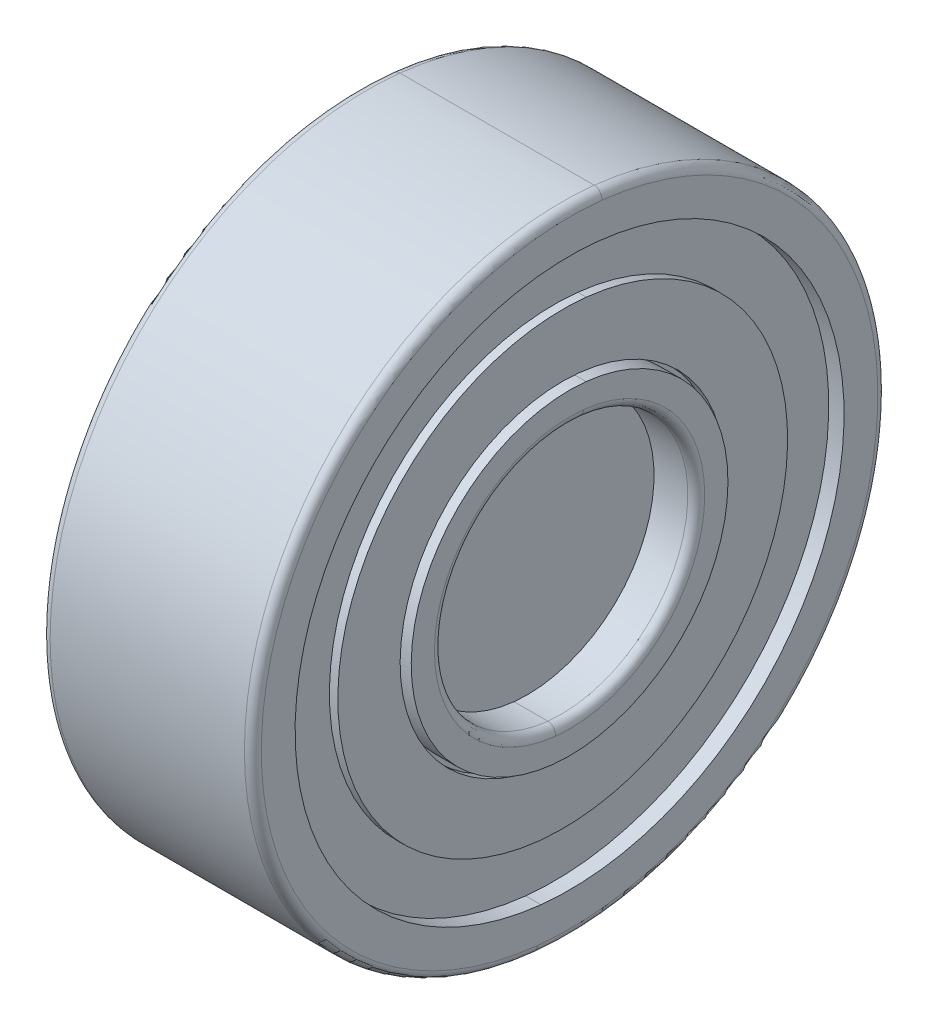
ISO-10303-21;
HEADER;
FILE_DESCRIPTION(('STEP AP214'),'2;1');
FILE_NAME('part.step','',(''),(''),'','','');
FILE_SCHEMA(('AUTOMOTIVE_DESIGN { 1 0 10303 214 1 1 1 1 }'));
ENDSEC;
DATA;
#1=APPLICATION_CONTEXT('core data for automotive mechanical design processes');
#2=APPLICATION_PROTOCOL_DEFINITION('international standard','automotive_design',2000,#1);
#3=PRODUCT_CONTEXT('',#1,'mechanical');
#4=PRODUCT('Part','Part','',(#3));
#5=PRODUCT_RELATED_PRODUCT_CATEGORY('part','',(#4));
#6=PRODUCT_DEFINITION_FORMATION('','',#4);
#7=PRODUCT_DEFINITION_CONTEXT('part definition',#1,'design');
#8=PRODUCT_DEFINITION('design','',#6,#7);
#9=PRODUCT_DEFINITION_SHAPE('','',#8);
#10=(LENGTH_UNIT() NAMED_UNIT(*) SI_UNIT(.MILLI.,.METRE.));
#11=(NAMED_UNIT(*) PLANE_ANGLE_UNIT() SI_UNIT($,.RADIAN.));
#12=(NAMED_UNIT(*) SI_UNIT($,.STERADIAN.) SOLID_ANGLE_UNIT());
#13=UNCERTAINTY_MEASURE_WITH_UNIT(LENGTH_MEASURE(1.E-05),#10,'distance_accuracy_value','');
#14=(GEOMETRIC_REPRESENTATION_CONTEXT(3) GLOBAL_UNCERTAINTY_ASSIGNED_CONTEXT((#13)) GLOBAL_UNIT_ASSIGNED_CONTEXT((#10,
#11,#12)) REPRESENTATION_CONTEXT('',''));
#15=CARTESIAN_POINT('',(0.,0.,0.));
#16=DIRECTION('',(0.,0.,1.));
#17=DIRECTION('',(1.,0.,0.));
#18=AXIS2_PLACEMENT_3D('',#15,#16,#17);
#19=CARTESIAN_POINT('',(-2.55,0.,0.));
#20=DIRECTION('',(1.,0.,0.));
#21=DIRECTION('',(0.,-0.994521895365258,0.104528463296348));
#22=AXIS2_PLACEMENT_3D('',#19,#20,#21);
#23=TOROIDAL_SURFACE('',#22,5.125,1.375);
#24=CARTESIAN_POINT('',(-2.55,0.,0.));
#25=DIRECTION('',(-1.,0.,0.));
#26=DIRECTION('',(0.,0.,1.));
#27=AXIS2_PLACEMENT_3D('',#24,#25,#26);
#28=CIRCLE('',#27,3.75);
#29=CARTESIAN_POINT('',(-2.55,3.72945710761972,-0.391981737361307));
#30=VERTEX_POINT('',#29);
#31=CARTESIAN_POINT('',(-2.55,-3.72945710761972,0.391981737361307));
#32=VERTEX_POINT('',#31);
#33=EDGE_CURVE('P0_E40',#30,#32,#28,.T.);
#34=ORIENTED_EDGE('',*,*,#33,.F.);
#35=CARTESIAN_POINT('',(-2.55,5.09692471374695,-0.535708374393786));
#36=DIRECTION('',(0.,0.104528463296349,0.994521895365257));
#37=DIRECTION('',(0.,0.994521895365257,-0.104528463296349));
#38=AXIS2_PLACEMENT_3D('',#35,#36,#37);
#39=CIRCLE('',#38,1.375);
#40=CARTESIAN_POINT('',(-1.8358571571,3.92836148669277,-0.412887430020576));
#41=VERTEX_POINT('',#40);
#42=EDGE_CURVE('P0_E11',#30,#41,#39,.T.);
#43=ORIENTED_EDGE('',*,*,#42,.T.);
#44=CARTESIAN_POINT('',(-1.8358571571,0.,0.));
#45=DIRECTION('',(1.,0.,0.));
#46=DIRECTION('',(0.,0.994521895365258,-0.104528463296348));
#47=AXIS2_PLACEMENT_3D('',#44,#45,#46);
#48=CIRCLE('',#47,3.95);
#49=CARTESIAN_POINT('',(-1.8358571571,-3.92836148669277,0.412887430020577));
#50=VERTEX_POINT('',#49);
#51=EDGE_CURVE('P0_E222',#50,#41,#48,.T.);
#52=ORIENTED_EDGE('',*,*,#51,.F.);
#53=CARTESIAN_POINT('',(-2.55,-5.09692471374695,0.535708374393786));
#54=DIRECTION('',(0.,0.104528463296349,0.994521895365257));
#55=DIRECTION('',(0.,-0.994521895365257,0.104528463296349));
#56=AXIS2_PLACEMENT_3D('',#53,#54,#55);
#57=CIRCLE('',#56,1.375);
#58=EDGE_CURVE('P0_E27',#50,#32,#57,.T.);
#59=ORIENTED_EDGE('',*,*,#58,.T.);
#60=EDGE_LOOP('',(#34,#43,#52,#59));
#61=FACE_BOUND('',#60,.T.);
#62=ADVANCED_FACE('P0_F16',(#61),#23,.F.);
#63=CARTESIAN_POINT('',(-2.55,0.,0.));
#64=DIRECTION('',(1.,0.,0.));
#65=DIRECTION('',(0.,-0.994521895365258,0.104528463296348));
#66=AXIS2_PLACEMENT_3D('',#63,#64,#65);
#67=TOROIDAL_SURFACE('',#66,5.125,1.375);
#68=CARTESIAN_POINT('',(-2.55,0.,0.));
#69=DIRECTION('',(-1.,0.,0.));
#70=DIRECTION('',(0.,0.,1.));
#71=AXIS2_PLACEMENT_3D('',#68,#69,#70);
#72=CIRCLE('',#71,3.75);
#73=EDGE_CURVE('P0_E213',#32,#30,#72,.T.);
#74=ORIENTED_EDGE('',*,*,#73,.F.);
#75=ORIENTED_EDGE('',*,*,#58,.F.);
#76=CARTESIAN_POINT('',(-1.8358571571,0.,0.));
#77=DIRECTION('',(1.,0.,0.));
#78=DIRECTION('',(0.,0.994521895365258,-0.104528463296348));
#79=AXIS2_PLACEMENT_3D('',#76,#77,#78);
#80=CIRCLE('',#79,3.95);
#81=EDGE_CURVE('P0_E208',#41,#50,#80,.T.);
#82=ORIENTED_EDGE('',*,*,#81,.F.);
#83=ORIENTED_EDGE('',*,*,#42,.F.);
#84=EDGE_LOOP('',(#74,#75,#82,#83));
#85=FACE_BOUND('',#84,.T.);
#86=ADVANCED_FACE('P0_F366',(#85),#67,.F.);
#87=CARTESIAN_POINT('',(-4.85,0.,0.));
#88=DIRECTION('',(1.,0.,0.));
#89=DIRECTION('',(0.,-0.994521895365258,0.104528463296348));
#90=AXIS2_PLACEMENT_3D('',#87,#88,#89);
#91=TOROIDAL_SURFACE('',#90,3.2,0.2);
#92=CARTESIAN_POINT('',(-4.85,-3.18247006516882,0.334491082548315));
#93=DIRECTION('',(0.,0.104528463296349,0.994521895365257));
#94=DIRECTION('',(0.,-0.994521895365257,0.104528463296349));
#95=AXIS2_PLACEMENT_3D('',#92,#93,#94);
#96=CIRCLE('',#95,0.2);
#97=CARTESIAN_POINT('',(-4.85,-2.98356568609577,0.313585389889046));
#98=VERTEX_POINT('',#97);
#99=CARTESIAN_POINT('',(-5.05,-3.18247006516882,0.334491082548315));
#100=VERTEX_POINT('',#99);
#101=EDGE_CURVE('P0_E145',#98,#100,#96,.T.);
#102=ORIENTED_EDGE('',*,*,#101,.F.);
#103=CARTESIAN_POINT('',(-4.85,0.,0.));
#104=DIRECTION('',(1.,0.,0.));
#105=DIRECTION('',(0.,0.994521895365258,-0.104528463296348));
#106=AXIS2_PLACEMENT_3D('',#103,#104,#105);
#107=CIRCLE('',#106,3.);
#108=CARTESIAN_POINT('',(-4.85,2.98356568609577,-0.313585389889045));
#109=VERTEX_POINT('',#108);
#110=EDGE_CURVE('P0_E138',#98,#109,#107,.T.);
#111=ORIENTED_EDGE('',*,*,#110,.T.);
#112=CARTESIAN_POINT('',(-4.85,3.18247006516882,-0.334491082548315));
#113=DIRECTION('',(0.,0.104528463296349,0.994521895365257));
#114=DIRECTION('',(0.,0.994521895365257,-0.104528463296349));
#115=AXIS2_PLACEMENT_3D('',#112,#113,#114);
#116=CIRCLE('',#115,0.2);
#117=CARTESIAN_POINT('',(-5.05,3.18247006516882,-0.334491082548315));
#118=VERTEX_POINT('',#117);
#119=EDGE_CURVE('P0_E131',#118,#109,#116,.T.);
#120=ORIENTED_EDGE('',*,*,#119,.F.);
#121=CARTESIAN_POINT('',(-5.05,0.,0.));
#122=DIRECTION('',(1.,0.,0.));
#123=DIRECTION('',(0.,0.994521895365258,-0.104528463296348));
#124=AXIS2_PLACEMENT_3D('',#121,#122,#123);
#125=CIRCLE('',#124,3.2);
#126=EDGE_CURVE('P0_E135',#100,#118,#125,.T.);
#127=ORIENTED_EDGE('',*,*,#126,.F.);
#128=EDGE_LOOP('',(#102,#111,#120,#127));
#129=FACE_BOUND('',#128,.T.);
#130=ADVANCED_FACE('P0_F134',(#129),#91,.T.);
#131=CARTESIAN_POINT('',(-2.55,0.,0.));
#132=DIRECTION('',(1.,0.,0.));
#133=DIRECTION('',(0.,0.994521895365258,-0.104528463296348));
#134=AXIS2_PLACEMENT_3D('',#131,#132,#133);
#135=CYLINDRICAL_SURFACE('',#134,3.);
#136=DIRECTION('',(1.,0.,0.));
#137=VECTOR('',#136,1.);
#138=CARTESIAN_POINT('',(-0.65,2.98356568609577,-0.313585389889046));
#139=LINE('',#138,#137);
#140=CARTESIAN_POINT('',(-1.05,2.98356568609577,-0.313585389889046));
#141=VERTEX_POINT('',#140);
#142=CARTESIAN_POINT('',(-0.25,2.98356568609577,-0.313585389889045));
#143=VERTEX_POINT('',#142);
#144=EDGE_CURVE('P0_E271',#141,#143,#139,.T.);
#145=ORIENTED_EDGE('',*,*,#144,.F.);
#146=CARTESIAN_POINT('',(-1.05,0.,0.));
#147=DIRECTION('',(-1.,0.,0.));
#148=DIRECTION('',(0.,0.994521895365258,-0.104528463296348));
#149=AXIS2_PLACEMENT_3D('',#146,#147,#148);
#150=CIRCLE('',#149,3.);
#151=CARTESIAN_POINT('',(-1.05,-2.98356568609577,0.313585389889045));
#152=VERTEX_POINT('',#151);
#153=EDGE_CURVE('P0_E235',#141,#152,#150,.T.);
#154=ORIENTED_EDGE('',*,*,#153,.T.);
#155=DIRECTION('',(-1.,0.,0.));
#156=VECTOR('',#155,1.);
#157=CARTESIAN_POINT('',(-0.65,-2.98356568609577,0.313585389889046));
#158=LINE('',#157,#156);
#159=CARTESIAN_POINT('',(-0.25,-2.98356568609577,0.313585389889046));
#160=VERTEX_POINT('',#159);
#161=EDGE_CURVE('P0_E172',#160,#152,#158,.T.);
#162=ORIENTED_EDGE('',*,*,#161,.F.);
#163=CARTESIAN_POINT('',(-0.25,0.,0.));
#164=DIRECTION('',(1.,0.,0.));
#165=DIRECTION('',(0.,0.994521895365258,-0.104528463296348));
#166=AXIS2_PLACEMENT_3D('',#163,#164,#165);
#167=CIRCLE('',#166,3.);
#168=EDGE_CURVE('P0_E226',#160,#143,#167,.T.);
#169=ORIENTED_EDGE('',*,*,#168,.T.);
#170=EDGE_LOOP('',(#145,#154,#162,#169));
#171=FACE_BOUND('',#170,.T.);
#172=ADVANCED_FACE('P0_F422',(#171),#135,.F.);
#173=CARTESIAN_POINT('',(-0.25,0.,0.));
#174=DIRECTION('',(1.,0.,0.));
#175=DIRECTION('',(0.,-0.994521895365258,0.104528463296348));
#176=AXIS2_PLACEMENT_3D('',#173,#174,#175);
#177=TOROIDAL_SURFACE('',#176,3.2,0.2);
#178=CARTESIAN_POINT('',(-0.25,-3.18247006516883,0.334491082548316));
#179=DIRECTION('',(0.,0.104528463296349,0.994521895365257));
#180=DIRECTION('',(0.,-0.994521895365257,0.104528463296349));
#181=AXIS2_PLACEMENT_3D('',#178,#179,#180);
#182=CIRCLE('',#181,0.2);
#183=CARTESIAN_POINT('',(-0.05,-3.18247006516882,0.334491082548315));
#184=VERTEX_POINT('',#183);
#185=EDGE_CURVE('P0_E173',#184,#160,#182,.T.);
#186=ORIENTED_EDGE('',*,*,#185,.F.);
#187=CARTESIAN_POINT('',(-0.05,0.,0.));
#188=DIRECTION('',(1.,0.,0.));
#189=DIRECTION('',(0.,0.994521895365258,-0.104528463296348));
#190=AXIS2_PLACEMENT_3D('',#187,#188,#189);
#191=CIRCLE('',#190,3.2);
#192=CARTESIAN_POINT('',(-0.05,3.18247006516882,-0.334491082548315));
#193=VERTEX_POINT('',#192);
#194=EDGE_CURVE('P0_E223',#184,#193,#191,.T.);
#195=ORIENTED_EDGE('',*,*,#194,.T.);
#196=CARTESIAN_POINT('',(-0.25,3.18247006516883,-0.334491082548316));
#197=DIRECTION('',(0.,0.104528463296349,0.994521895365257));
#198=DIRECTION('',(0.,0.994521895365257,-0.104528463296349));
#199=AXIS2_PLACEMENT_3D('',#196,#197,#198);
#200=CIRCLE('',#199,0.2);
#201=EDGE_CURVE('P0_E178',#143,#193,#200,.T.);
#202=ORIENTED_EDGE('',*,*,#201,.F.);
#203=ORIENTED_EDGE('',*,*,#168,.F.);
#204=EDGE_LOOP('',(#186,#195,#202,#203));
#205=FACE_BOUND('',#204,.T.);
#206=ADVANCED_FACE('P0_F377',(#205),#177,.T.);
#207=CARTESIAN_POINT('',(-0.33125,0.,0.));
#208=DIRECTION('',(1.,0.,0.));
#209=DIRECTION('',(0.,0.994521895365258,-0.104528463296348));
#210=AXIS2_PLACEMENT_3D('',#207,#208,#209);
#211=CYLINDRICAL_SURFACE('',#210,3.75);
#212=DIRECTION('',(1.,0.,0.));
#213=VECTOR('',#212,1.);
#214=CARTESIAN_POINT('',(-0.33125,3.72945710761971,-0.391981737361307));
#215=LINE('',#214,#213);
#216=CARTESIAN_POINT('',(-0.6125,3.72945710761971,-0.391981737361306));
#217=VERTEX_POINT('',#216);
#218=CARTESIAN_POINT('',(-0.05,3.72945710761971,-0.391981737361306));
#219=VERTEX_POINT('',#218);
#220=EDGE_CURVE('P0_E194',#217,#219,#215,.T.);
#221=ORIENTED_EDGE('',*,*,#220,.F.);
#222=CARTESIAN_POINT('',(-0.6125,0.,0.));
#223=DIRECTION('',(1.,0.,0.));
#224=DIRECTION('',(0.,0.994521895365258,-0.104528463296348));
#225=AXIS2_PLACEMENT_3D('',#222,#223,#224);
#226=CIRCLE('',#225,3.75);
#227=CARTESIAN_POINT('',(-0.6125,-3.72945710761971,0.391981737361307));
#228=VERTEX_POINT('',#227);
#229=EDGE_CURVE('P0_E212',#217,#228,#226,.T.);
#230=ORIENTED_EDGE('',*,*,#229,.T.);
#231=DIRECTION('',(-1.,0.,0.));
#232=VECTOR('',#231,1.);
#233=CARTESIAN_POINT('',(-0.33125,-3.72945710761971,0.391981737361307));
#234=LINE('',#233,#232);
#235=CARTESIAN_POINT('',(-0.05,-3.72945710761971,0.391981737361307));
#236=VERTEX_POINT('',#235);
#237=EDGE_CURVE('P0_E199',#236,#228,#234,.T.);
#238=ORIENTED_EDGE('',*,*,#237,.F.);
#239=CARTESIAN_POINT('',(-0.05,0.,0.));
#240=DIRECTION('',(1.,0.,0.));
#241=DIRECTION('',(0.,0.994521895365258,-0.104528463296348));
#242=AXIS2_PLACEMENT_3D('',#239,#240,#241);
#243=CIRCLE('',#242,3.75);
#244=EDGE_CURVE('P0_E20',#219,#236,#243,.T.);
#245=ORIENTED_EDGE('',*,*,#244,.F.);
#246=EDGE_LOOP('',(#221,#230,#238,#245));
#247=FACE_BOUND('',#246,.T.);
#248=ADVANCED_FACE('P0_F406',(#247),#211,.T.);
#249=CARTESIAN_POINT('',(-1.22417857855,0.,0.));
#250=DIRECTION('',(1.,0.,0.));
#251=DIRECTION('',(0.,0.994521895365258,-0.104528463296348));
#252=AXIS2_PLACEMENT_3D('',#249,#250,#251);
#253=CYLINDRICAL_SURFACE('',#252,3.95);
#254=DIRECTION('',(1.,0.,0.));
#255=VECTOR('',#254,1.);
#256=CARTESIAN_POINT('',(-1.22417857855,3.92836148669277,-0.412887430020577));
#257=LINE('',#256,#255);
#258=CARTESIAN_POINT('',(-0.6125,3.92836148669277,-0.412887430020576));
#259=VERTEX_POINT('',#258);
#260=EDGE_CURVE('P0_E193',#41,#259,#257,.T.);
#261=ORIENTED_EDGE('',*,*,#260,.F.);
#262=ORIENTED_EDGE('',*,*,#81,.T.);
#263=DIRECTION('',(-1.,0.,0.));
#264=VECTOR('',#263,1.);
#265=CARTESIAN_POINT('',(-1.22417857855,-3.92836148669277,0.412887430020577));
#266=LINE('',#265,#264);
#267=CARTESIAN_POINT('',(-0.6125,-3.92836148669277,0.412887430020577));
#268=VERTEX_POINT('',#267);
#269=EDGE_CURVE('P0_E217',#268,#50,#266,.T.);
#270=ORIENTED_EDGE('',*,*,#269,.F.);
#271=CARTESIAN_POINT('',(-0.6125,0.,0.));
#272=DIRECTION('',(1.,0.,0.));
#273=DIRECTION('',(0.,0.994521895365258,-0.104528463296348));
#274=AXIS2_PLACEMENT_3D('',#271,#272,#273);
#275=CIRCLE('',#274,3.95);
#276=EDGE_CURVE('P0_E295',#259,#268,#275,.T.);
#277=ORIENTED_EDGE('',*,*,#276,.F.);
#278=EDGE_LOOP('',(#261,#262,#270,#277));
#279=FACE_BOUND('',#278,.T.);
#280=ADVANCED_FACE('P0_F400',(#279),#253,.T.);
#281=CARTESIAN_POINT('',(-2.55,0.,0.));
#282=DIRECTION('',(1.,0.,0.));
#283=DIRECTION('',(0.,-0.994521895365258,0.104528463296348));
#284=AXIS2_PLACEMENT_3D('',#281,#282,#283);
#285=TOROIDAL_SURFACE('',#284,5.125,1.375);
#286=ORIENTED_EDGE('',*,*,#73,.T.);
#287=CARTESIAN_POINT('',(-2.55,5.09692471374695,-0.535708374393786));
#288=DIRECTION('',(0.,0.104528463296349,0.994521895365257));
#289=DIRECTION('',(0.,0.994521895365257,-0.104528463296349));
#290=AXIS2_PLACEMENT_3D('',#287,#288,#289);
#291=CIRCLE('',#290,1.375);
#292=CARTESIAN_POINT('',(-3.26414284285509,3.92836148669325,-0.412887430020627));
#293=VERTEX_POINT('',#292);
#294=EDGE_CURVE('P0_E188',#293,#30,#291,.T.);
#295=ORIENTED_EDGE('',*,*,#294,.F.);
#296=CARTESIAN_POINT('',(-3.26414284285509,0.,0.));
#297=DIRECTION('',(1.,0.,0.));
#298=DIRECTION('',(0.,0.994521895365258,-0.104528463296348));
#299=AXIS2_PLACEMENT_3D('',#296,#297,#298);
#300=CIRCLE('',#299,3.95000000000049);
#301=CARTESIAN_POINT('',(-3.26414284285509,-3.92836148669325,0.412887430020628));
#302=VERTEX_POINT('',#301);
#303=EDGE_CURVE('P0_E187',#293,#302,#300,.T.);
#304=ORIENTED_EDGE('',*,*,#303,.T.);
#305=CARTESIAN_POINT('',(-2.55,-5.09692471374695,0.535708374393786));
#306=DIRECTION('',(0.,0.104528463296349,0.994521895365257));
#307=DIRECTION('',(0.,-0.994521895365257,0.104528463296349));
#308=AXIS2_PLACEMENT_3D('',#305,#306,#307);
#309=CIRCLE('',#308,1.375);
#310=EDGE_CURVE('P0_E181',#32,#302,#309,.T.);
#311=ORIENTED_EDGE('',*,*,#310,.F.);
#312=EDGE_LOOP('',(#286,#295,#304,#311));
#313=FACE_BOUND('',#312,.T.);
#314=ADVANCED_FACE('P0_F332',(#313),#285,.F.);
#315=CARTESIAN_POINT('',(-3.87582142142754,0.,0.));
#316=DIRECTION('',(1.,0.,0.));
#317=DIRECTION('',(0.,0.994521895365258,-0.104528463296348));
#318=AXIS2_PLACEMENT_3D('',#315,#316,#317);
#319=CYLINDRICAL_SURFACE('',#318,3.95000000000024);
#320=DIRECTION('',(1.,0.,0.));
#321=VECTOR('',#320,1.);
#322=CARTESIAN_POINT('',(-3.87582142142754,3.92836148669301,-0.412887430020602));
#323=LINE('',#322,#321);
#324=CARTESIAN_POINT('',(-4.4875,3.92836148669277,-0.412887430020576));
#325=VERTEX_POINT('',#324);
#326=EDGE_CURVE('P0_E203',#325,#293,#323,.T.);
#327=ORIENTED_EDGE('',*,*,#326,.F.);
#328=CARTESIAN_POINT('',(-4.4875,0.,0.));
#329=DIRECTION('',(1.,0.,0.));
#330=DIRECTION('',(0.,0.994521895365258,-0.104528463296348));
#331=AXIS2_PLACEMENT_3D('',#328,#329,#330);
#332=CIRCLE('',#331,3.95);
#333=CARTESIAN_POINT('',(-4.4875,-3.92836148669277,0.412887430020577));
#334=VERTEX_POINT('',#333);
#335=EDGE_CURVE('P0_E183',#325,#334,#332,.T.);
#336=ORIENTED_EDGE('',*,*,#335,.T.);
#337=DIRECTION('',(-1.,0.,0.));
#338=VECTOR('',#337,1.);
#339=CARTESIAN_POINT('',(-3.87582142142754,-3.92836148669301,0.412887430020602));
#340=LINE('',#339,#338);
#341=EDGE_CURVE('P0_E200',#302,#334,#340,.T.);
#342=ORIENTED_EDGE('',*,*,#341,.F.);
#343=ORIENTED_EDGE('',*,*,#303,.F.);
#344=EDGE_LOOP('',(#327,#336,#342,#343));
#345=FACE_BOUND('',#344,.T.);
#346=ADVANCED_FACE('P0_F18',(#345),#319,.T.);
#347=CARTESIAN_POINT('',(-4.76875,0.,0.));
#348=DIRECTION('',(1.,0.,0.));
#349=DIRECTION('',(0.,0.994521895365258,-0.104528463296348));
#350=AXIS2_PLACEMENT_3D('',#347,#348,#349);
#351=CYLINDRICAL_SURFACE('',#350,3.75);
#352=DIRECTION('',(1.,0.,0.));
#353=VECTOR('',#352,1.);
#354=CARTESIAN_POINT('',(-4.76875,3.72945710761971,-0.391981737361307));
#355=LINE('',#354,#353);
#356=CARTESIAN_POINT('',(-5.05,3.72945710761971,-0.391981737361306));
#357=VERTEX_POINT('',#356);
#358=CARTESIAN_POINT('',(-4.4875,3.72945710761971,-0.391981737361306));
#359=VERTEX_POINT('',#358);
#360=EDGE_CURVE('P0_E152',#357,#359,#355,.T.);
#361=ORIENTED_EDGE('',*,*,#360,.F.);
#362=CARTESIAN_POINT('',(-5.05,0.,0.));
#363=DIRECTION('',(1.,0.,0.));
#364=DIRECTION('',(0.,0.994521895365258,-0.104528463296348));
#365=AXIS2_PLACEMENT_3D('',#362,#363,#364);
#366=CIRCLE('',#365,3.75);
#367=CARTESIAN_POINT('',(-5.05,-3.72945710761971,0.391981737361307));
#368=VERTEX_POINT('',#367);
#369=EDGE_CURVE('P0_E167',#357,#368,#366,.T.);
#370=ORIENTED_EDGE('',*,*,#369,.T.);
#371=DIRECTION('',(-1.,0.,0.));
#372=VECTOR('',#371,1.);
#373=CARTESIAN_POINT('',(-4.76875,-3.72945710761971,0.391981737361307));
#374=LINE('',#373,#372);
#375=CARTESIAN_POINT('',(-4.4875,-3.72945710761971,0.391981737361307));
#376=VERTEX_POINT('',#375);
#377=EDGE_CURVE('P0_E250',#376,#368,#374,.T.);
#378=ORIENTED_EDGE('',*,*,#377,.F.);
#379=CARTESIAN_POINT('',(-4.4875,0.,0.));
#380=DIRECTION('',(1.,0.,0.));
#381=DIRECTION('',(0.,0.994521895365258,-0.104528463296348));
#382=AXIS2_PLACEMENT_3D('',#379,#380,#381);
#383=CIRCLE('',#382,3.75);
#384=EDGE_CURVE('P0_E256',#359,#376,#383,.T.);
#385=ORIENTED_EDGE('',*,*,#384,.F.);
#386=EDGE_LOOP('',(#361,#370,#378,#385));
#387=FACE_BOUND('',#386,.T.);
#388=ADVANCED_FACE('P0_F387',(#387),#351,.T.);
#389=CARTESIAN_POINT('',(-2.55,0.,0.));
#390=DIRECTION('',(1.,0.,0.));
#391=DIRECTION('',(0.,0.994521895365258,-0.104528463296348));
#392=AXIS2_PLACEMENT_3D('',#389,#390,#391);
#393=CYLINDRICAL_SURFACE('',#392,3.);
#394=DIRECTION('',(1.,0.,0.));
#395=VECTOR('',#394,1.);
#396=CARTESIAN_POINT('',(-3.95,2.98356568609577,-0.313585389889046));
#397=LINE('',#396,#395);
#398=CARTESIAN_POINT('',(-3.05,2.98356568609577,-0.313585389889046));
#399=VERTEX_POINT('',#398);
#400=EDGE_CURVE('P0_E207',#109,#399,#397,.T.);
#401=ORIENTED_EDGE('',*,*,#400,.F.);
#402=ORIENTED_EDGE('',*,*,#110,.F.);
#403=DIRECTION('',(-1.,0.,0.));
#404=VECTOR('',#403,1.);
#405=CARTESIAN_POINT('',(-3.95,-2.98356568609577,0.313585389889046));
#406=LINE('',#405,#404);
#407=CARTESIAN_POINT('',(-3.05,-2.98356568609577,0.313585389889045));
#408=VERTEX_POINT('',#407);
#409=EDGE_CURVE('P0_E156',#408,#98,#406,.T.);
#410=ORIENTED_EDGE('',*,*,#409,.F.);
#411=CARTESIAN_POINT('',(-3.05,0.,0.));
#412=DIRECTION('',(1.,0.,0.));
#413=DIRECTION('',(0.,0.994521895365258,-0.104528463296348));
#414=AXIS2_PLACEMENT_3D('',#411,#412,#413);
#415=CIRCLE('',#414,3.);
#416=EDGE_CURVE('P0_E264',#408,#399,#415,.T.);
#417=ORIENTED_EDGE('',*,*,#416,.T.);
#418=EDGE_LOOP('',(#401,#402,#410,#417));
#419=FACE_BOUND('',#418,.T.);
#420=ADVANCED_FACE('P0_F383',(#419),#393,.F.);
#421=CARTESIAN_POINT('',(-1.05,-1.49178284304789,0.156792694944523));
#422=DIRECTION('',(1.,0.,0.));
#423=DIRECTION('',(0.,1.,0.));
#424=AXIS2_PLACEMENT_3D('',#421,#422,#423);
#425=PLANE('',#424);
#426=CARTESIAN_POINT('',(-1.05,0.,0.));
#427=DIRECTION('',(-1.,0.,0.));
#428=DIRECTION('',(0.,0.994521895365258,-0.104528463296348));
#429=AXIS2_PLACEMENT_3D('',#426,#427,#428);
#430=CIRCLE('',#429,3.);
#431=EDGE_CURVE('P0_E169',#152,#141,#430,.T.);
#432=ORIENTED_EDGE('',*,*,#431,.F.);
#433=ORIENTED_EDGE('',*,*,#153,.F.);
#434=EDGE_LOOP('',(#432,#433));
#435=FACE_BOUND('',#434,.T.);
#436=ADVANCED_FACE('P0_F379',(#435),#425,.T.);
#437=CARTESIAN_POINT('',(-3.05,-1.49178284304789,0.156792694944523));
#438=DIRECTION('',(-1.,0.,0.));
#439=DIRECTION('',(0.,0.,1.));
#440=AXIS2_PLACEMENT_3D('',#437,#438,#439);
#441=PLANE('',#440);
#442=ORIENTED_EDGE('',*,*,#416,.F.);
#443=CARTESIAN_POINT('',(-3.05,0.,0.));
#444=DIRECTION('',(1.,0.,0.));
#445=DIRECTION('',(0.,0.994521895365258,-0.104528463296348));
#446=AXIS2_PLACEMENT_3D('',#443,#444,#445);
#447=CIRCLE('',#446,3.);
#448=EDGE_CURVE('P0_E163',#399,#408,#447,.T.);
#449=ORIENTED_EDGE('',*,*,#448,.F.);
#450=EDGE_LOOP('',(#442,#449));
#451=FACE_BOUND('',#450,.T.);
#452=ADVANCED_FACE('P0_F382',(#451),#441,.T.);
#453=CARTESIAN_POINT('',(-2.55,0.,0.));
#454=DIRECTION('',(1.,0.,0.));
#455=DIRECTION('',(0.,0.994521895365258,-0.104528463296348));
#456=AXIS2_PLACEMENT_3D('',#453,#454,#455);
#457=CYLINDRICAL_SURFACE('',#456,3.);
#458=ORIENTED_EDGE('',*,*,#400,.T.);
#459=ORIENTED_EDGE('',*,*,#448,.T.);
#460=ORIENTED_EDGE('',*,*,#409,.T.);
#461=CARTESIAN_POINT('',(-4.85,0.,0.));
#462=DIRECTION('',(1.,0.,0.));
#463=DIRECTION('',(0.,0.994521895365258,-0.104528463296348));
#464=AXIS2_PLACEMENT_3D('',#461,#462,#463);
#465=CIRCLE('',#464,3.);
#466=EDGE_CURVE('P0_E146',#109,#98,#465,.T.);
#467=ORIENTED_EDGE('',*,*,#466,.F.);
#468=EDGE_LOOP('',(#458,#459,#460,#467));
#469=FACE_BOUND('',#468,.T.);
#470=ADVANCED_FACE('P0_F507',(#469),#457,.F.);
#471=CARTESIAN_POINT('',(-5.05,3.45596358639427,-0.363236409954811));
#472=DIRECTION('',(-1.,0.,0.));
#473=DIRECTION('',(0.,0.,1.));
#474=AXIS2_PLACEMENT_3D('',#471,#472,#473);
#475=PLANE('',#474);
#476=ORIENTED_EDGE('',*,*,#369,.F.);
#477=CARTESIAN_POINT('',(-5.05,0.,0.));
#478=DIRECTION('',(1.,0.,0.));
#479=DIRECTION('',(0.,0.994521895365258,-0.104528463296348));
#480=AXIS2_PLACEMENT_3D('',#477,#478,#479);
#481=CIRCLE('',#480,3.75);
#482=EDGE_CURVE('P0_E259',#368,#357,#481,.T.);
#483=ORIENTED_EDGE('',*,*,#482,.F.);
#484=EDGE_LOOP('',(#476,#483));
#485=FACE_BOUND('',#484,.T.);
#486=CARTESIAN_POINT('',(-5.05,0.,0.));
#487=DIRECTION('',(1.,0.,0.));
#488=DIRECTION('',(0.,0.994521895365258,-0.104528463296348));
#489=AXIS2_PLACEMENT_3D('',#486,#487,#488);
#490=CIRCLE('',#489,3.2);
#491=EDGE_CURVE('P0_E150',#118,#100,#490,.T.);
#492=ORIENTED_EDGE('',*,*,#491,.T.);
#493=ORIENTED_EDGE('',*,*,#126,.T.);
#494=EDGE_LOOP('',(#492,#493));
#495=FACE_BOUND('',#494,.T.);
#496=ADVANCED_FACE('P0_F149',(#485,#495),#475,.T.);
#497=CARTESIAN_POINT('',(-4.76875,0.,0.));
#498=DIRECTION('',(1.,0.,0.));
#499=DIRECTION('',(0.,0.994521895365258,-0.104528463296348));
#500=AXIS2_PLACEMENT_3D('',#497,#498,#499);
#501=CYLINDRICAL_SURFACE('',#500,3.75);
#502=ORIENTED_EDGE('',*,*,#360,.T.);
#503=CARTESIAN_POINT('',(-4.4875,0.,0.));
#504=DIRECTION('',(1.,0.,0.));
#505=DIRECTION('',(0.,0.994521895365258,-0.104528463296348));
#506=AXIS2_PLACEMENT_3D('',#503,#504,#505);
#507=CIRCLE('',#506,3.75);
#508=EDGE_CURVE('P0_E260',#376,#359,#507,.T.);
#509=ORIENTED_EDGE('',*,*,#508,.F.);
#510=ORIENTED_EDGE('',*,*,#377,.T.);
#511=ORIENTED_EDGE('',*,*,#482,.T.);
#512=EDGE_LOOP('',(#502,#509,#510,#511));
#513=FACE_BOUND('',#512,.T.);
#514=ADVANCED_FACE('P0_F434',(#513),#501,.T.);
#515=CARTESIAN_POINT('',(-4.4875,3.82890929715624,-0.402434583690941));
#516=DIRECTION('',(-1.,0.,0.));
#517=DIRECTION('',(0.,0.,1.));
#518=AXIS2_PLACEMENT_3D('',#515,#516,#517);
#519=PLANE('',#518);
#520=ORIENTED_EDGE('',*,*,#335,.F.);
#521=CARTESIAN_POINT('',(-4.4875,0.,0.));
#522=DIRECTION('',(1.,0.,0.));
#523=DIRECTION('',(0.,0.994521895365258,-0.104528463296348));
#524=AXIS2_PLACEMENT_3D('',#521,#522,#523);
#525=CIRCLE('',#524,3.95);
#526=EDGE_CURVE('P0_E180',#334,#325,#525,.T.);
#527=ORIENTED_EDGE('',*,*,#526,.F.);
#528=EDGE_LOOP('',(#520,#527));
#529=FACE_BOUND('',#528,.T.);
#530=ORIENTED_EDGE('',*,*,#384,.T.);
#531=ORIENTED_EDGE('',*,*,#508,.T.);
#532=EDGE_LOOP('',(#530,#531));
#533=FACE_BOUND('',#532,.T.);
#534=ADVANCED_FACE('P0_F437',(#529,#533),#519,.T.);
#535=CARTESIAN_POINT('',(-3.87582142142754,0.,0.));
#536=DIRECTION('',(1.,0.,0.));
#537=DIRECTION('',(0.,0.994521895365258,-0.104528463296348));
#538=AXIS2_PLACEMENT_3D('',#535,#536,#537);
#539=CYLINDRICAL_SURFACE('',#538,3.95000000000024);
#540=ORIENTED_EDGE('',*,*,#326,.T.);
#541=CARTESIAN_POINT('',(-3.26414284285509,0.,0.));
#542=DIRECTION('',(1.,0.,0.));
#543=DIRECTION('',(0.,0.994521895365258,-0.104528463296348));
#544=AXIS2_PLACEMENT_3D('',#541,#542,#543);
#545=CIRCLE('',#544,3.95000000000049);
#546=EDGE_CURVE('P0_E192',#302,#293,#545,.T.);
#547=ORIENTED_EDGE('',*,*,#546,.F.);
#548=ORIENTED_EDGE('',*,*,#341,.T.);
#549=ORIENTED_EDGE('',*,*,#526,.T.);
#550=EDGE_LOOP('',(#540,#547,#548,#549));
#551=FACE_BOUND('',#550,.T.);
#552=ADVANCED_FACE('P0_F337',(#551),#539,.T.);
#553=CARTESIAN_POINT('',(-2.55,0.,0.));
#554=DIRECTION('',(1.,0.,0.));
#555=DIRECTION('',(0.,-0.994521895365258,0.104528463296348));
#556=AXIS2_PLACEMENT_3D('',#553,#554,#555);
#557=TOROIDAL_SURFACE('',#556,5.125,1.375);
#558=ORIENTED_EDGE('',*,*,#33,.T.);
#559=ORIENTED_EDGE('',*,*,#310,.T.);
#560=ORIENTED_EDGE('',*,*,#546,.T.);
#561=ORIENTED_EDGE('',*,*,#294,.T.);
#562=EDGE_LOOP('',(#558,#559,#560,#561));
#563=FACE_BOUND('',#562,.T.);
#564=ADVANCED_FACE('P0_F339',(#563),#557,.F.);
#565=CARTESIAN_POINT('',(-1.22417857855,0.,0.));
#566=DIRECTION('',(1.,0.,0.));
#567=DIRECTION('',(0.,0.994521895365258,-0.104528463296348));
#568=AXIS2_PLACEMENT_3D('',#565,#566,#567);
#569=CYLINDRICAL_SURFACE('',#568,3.95);
#570=ORIENTED_EDGE('',*,*,#260,.T.);
#571=CARTESIAN_POINT('',(-0.6125,0.,0.));
#572=DIRECTION('',(1.,0.,0.));
#573=DIRECTION('',(0.,0.994521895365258,-0.104528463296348));
#574=AXIS2_PLACEMENT_3D('',#571,#572,#573);
#575=CIRCLE('',#574,3.95);
#576=EDGE_CURVE('P0_E198',#268,#259,#575,.T.);
#577=ORIENTED_EDGE('',*,*,#576,.F.);
#578=ORIENTED_EDGE('',*,*,#269,.T.);
#579=ORIENTED_EDGE('',*,*,#51,.T.);
#580=EDGE_LOOP('',(#570,#577,#578,#579));
#581=FACE_BOUND('',#580,.T.);
#582=ADVANCED_FACE('P0_F410',(#581),#569,.T.);
#583=CARTESIAN_POINT('',(-0.6125,3.82890929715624,-0.402434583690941));
#584=DIRECTION('',(1.,0.,0.));
#585=DIRECTION('',(0.,1.,0.));
#586=AXIS2_PLACEMENT_3D('',#583,#584,#585);
#587=PLANE('',#586);
#588=ORIENTED_EDGE('',*,*,#276,.T.);
#589=ORIENTED_EDGE('',*,*,#576,.T.);
#590=EDGE_LOOP('',(#588,#589));
#591=FACE_BOUND('',#590,.T.);
#592=ORIENTED_EDGE('',*,*,#229,.F.);
#593=CARTESIAN_POINT('',(-0.6125,0.,0.));
#594=DIRECTION('',(1.,0.,0.));
#595=DIRECTION('',(0.,0.994521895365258,-0.104528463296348));
#596=AXIS2_PLACEMENT_3D('',#593,#594,#595);
#597=CIRCLE('',#596,3.75);
#598=EDGE_CURVE('P0_E263',#228,#217,#597,.T.);
#599=ORIENTED_EDGE('',*,*,#598,.F.);
#600=EDGE_LOOP('',(#592,#599));
#601=FACE_BOUND('',#600,.T.);
#602=ADVANCED_FACE('P0_F440',(#591,#601),#587,.T.);
#603=CARTESIAN_POINT('',(-0.33125,0.,0.));
#604=DIRECTION('',(1.,0.,0.));
#605=DIRECTION('',(0.,0.994521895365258,-0.104528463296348));
#606=AXIS2_PLACEMENT_3D('',#603,#604,#605);
#607=CYLINDRICAL_SURFACE('',#606,3.75);
#608=ORIENTED_EDGE('',*,*,#220,.T.);
#609=CARTESIAN_POINT('',(-0.05,0.,0.));
#610=DIRECTION('',(1.,0.,0.));
#611=DIRECTION('',(0.,0.994521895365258,-0.104528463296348));
#612=AXIS2_PLACEMENT_3D('',#609,#610,#611);
#613=CIRCLE('',#612,3.75);
#614=EDGE_CURVE('P0_E177',#236,#219,#613,.T.);
#615=ORIENTED_EDGE('',*,*,#614,.F.);
#616=ORIENTED_EDGE('',*,*,#237,.T.);
#617=ORIENTED_EDGE('',*,*,#598,.T.);
#618=EDGE_LOOP('',(#608,#615,#616,#617));
#619=FACE_BOUND('',#618,.T.);
#620=ADVANCED_FACE('P0_F396',(#619),#607,.T.);
#621=CARTESIAN_POINT('',(-0.05,3.45596358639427,-0.363236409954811));
#622=DIRECTION('',(1.,0.,0.));
#623=DIRECTION('',(0.,1.,0.));
#624=AXIS2_PLACEMENT_3D('',#621,#622,#623);
#625=PLANE('',#624);
#626=ORIENTED_EDGE('',*,*,#244,.T.);
#627=ORIENTED_EDGE('',*,*,#614,.T.);
#628=EDGE_LOOP('',(#626,#627));
#629=FACE_BOUND('',#628,.T.);
#630=CARTESIAN_POINT('',(-0.05,0.,0.));
#631=DIRECTION('',(1.,0.,0.));
#632=DIRECTION('',(0.,0.994521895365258,-0.104528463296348));
#633=AXIS2_PLACEMENT_3D('',#630,#631,#632);
#634=CIRCLE('',#633,3.2);
#635=EDGE_CURVE('P0_E274',#193,#184,#634,.T.);
#636=ORIENTED_EDGE('',*,*,#635,.F.);
#637=ORIENTED_EDGE('',*,*,#194,.F.);
#638=EDGE_LOOP('',(#636,#637));
#639=FACE_BOUND('',#638,.T.);
#640=ADVANCED_FACE('P0_F392',(#629,#639),#625,.T.);
#641=CARTESIAN_POINT('',(-0.25,0.,0.));
#642=DIRECTION('',(1.,0.,0.));
#643=DIRECTION('',(0.,-0.994521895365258,0.104528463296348));
#644=AXIS2_PLACEMENT_3D('',#641,#642,#643);
#645=TOROIDAL_SURFACE('',#644,3.2,0.2);
#646=ORIENTED_EDGE('',*,*,#185,.T.);
#647=CARTESIAN_POINT('',(-0.25,0.,0.));
#648=DIRECTION('',(1.,0.,0.));
#649=DIRECTION('',(0.,0.994521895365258,-0.104528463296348));
#650=AXIS2_PLACEMENT_3D('',#647,#648,#649);
#651=CIRCLE('',#650,3.);
#652=EDGE_CURVE('P0_E275',#143,#160,#651,.T.);
#653=ORIENTED_EDGE('',*,*,#652,.F.);
#654=ORIENTED_EDGE('',*,*,#201,.T.);
#655=ORIENTED_EDGE('',*,*,#635,.T.);
#656=EDGE_LOOP('',(#646,#653,#654,#655));
#657=FACE_BOUND('',#656,.T.);
#658=ADVANCED_FACE('P0_F395',(#657),#645,.T.);
#659=CARTESIAN_POINT('',(-2.55,0.,0.));
#660=DIRECTION('',(1.,0.,0.));
#661=DIRECTION('',(0.,0.994521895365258,-0.104528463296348));
#662=AXIS2_PLACEMENT_3D('',#659,#660,#661);
#663=CYLINDRICAL_SURFACE('',#662,3.);
#664=ORIENTED_EDGE('',*,*,#144,.T.);
#665=ORIENTED_EDGE('',*,*,#652,.T.);
#666=ORIENTED_EDGE('',*,*,#161,.T.);
#667=ORIENTED_EDGE('',*,*,#431,.T.);
#668=EDGE_LOOP('',(#664,#665,#666,#667));
#669=FACE_BOUND('',#668,.T.);
#670=ADVANCED_FACE('P0_F403',(#669),#663,.F.);
#671=CARTESIAN_POINT('',(-4.85,0.,0.));
#672=DIRECTION('',(1.,0.,0.));
#673=DIRECTION('',(0.,-0.994521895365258,0.104528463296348));
#674=AXIS2_PLACEMENT_3D('',#671,#672,#673);
#675=TOROIDAL_SURFACE('',#674,3.2,0.2);
#676=ORIENTED_EDGE('',*,*,#101,.T.);
#677=ORIENTED_EDGE('',*,*,#491,.F.);
#678=ORIENTED_EDGE('',*,*,#119,.T.);
#679=ORIENTED_EDGE('',*,*,#466,.T.);
#680=EDGE_LOOP('',(#676,#677,#678,#679));
#681=FACE_BOUND('',#680,.T.);
#682=ADVANCED_FACE('P0_F154',(#681),#675,.T.);
#683=CLOSED_SHELL('',(#62,#86,#130,#172,#206,#248,#280,#314,#346,#388,#420,#436,#452,#470,#496,
#514,#534,#552,#564,#582,#602,#620,#640,#658,#670,#682));
#684=MANIFOLD_SOLID_BREP('P0_B1',#683);
#685=CARTESIAN_POINT('',(-2.55,0.,0.));
#686=DIRECTION('',(1.,0.,0.));
#687=DIRECTION('',(0.,-0.994521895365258,0.104528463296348));
#688=AXIS2_PLACEMENT_3D('',#685,#686,#687);
#689=TOROIDAL_SURFACE('',#688,5.125,1.375);
#690=CARTESIAN_POINT('',(-2.55,0.,0.));
#691=DIRECTION('',(1.,0.,0.));
#692=DIRECTION('',(0.,0.,1.));
#693=AXIS2_PLACEMENT_3D('',#690,#691,#692);
#694=CIRCLE('',#693,6.5);
#695=CARTESIAN_POINT('',(-2.55,-6.46439231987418,0.679435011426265));
#696=VERTEX_POINT('',#695);
#697=CARTESIAN_POINT('',(-2.55,6.46439231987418,-0.679435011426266));
#698=VERTEX_POINT('',#697);
#699=EDGE_CURVE('P1_E40',#696,#698,#694,.T.);
#700=ORIENTED_EDGE('',*,*,#699,.F.);
#701=CARTESIAN_POINT('',(-2.55,-5.09692471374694,0.535708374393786));
#702=DIRECTION('',(0.,0.104528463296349,0.994521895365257));
#703=DIRECTION('',(0.,-0.994521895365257,0.104528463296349));
#704=AXIS2_PLACEMENT_3D('',#701,#702,#703);
#705=CIRCLE('',#704,1.375);
#706=CARTESIAN_POINT('',(-1.83585715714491,-6.26548794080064,0.658529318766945));
#707=VERTEX_POINT('',#706);
#708=EDGE_CURVE('P1_E11',#696,#707,#705,.T.);
#709=ORIENTED_EDGE('',*,*,#708,.T.);
#710=CARTESIAN_POINT('',(-1.83585715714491,0.,0.));
#711=DIRECTION('',(1.,0.,0.));
#712=DIRECTION('',(0.,0.994521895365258,-0.104528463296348));
#713=AXIS2_PLACEMENT_3D('',#710,#711,#712);
#714=CIRCLE('',#713,6.29999999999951);
#715=CARTESIAN_POINT('',(-1.83585715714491,6.26548794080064,-0.658529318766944));
#716=VERTEX_POINT('',#715);
#717=EDGE_CURVE('P1_E27',#707,#716,#714,.T.);
#718=ORIENTED_EDGE('',*,*,#717,.T.);
#719=CARTESIAN_POINT('',(-2.55,5.09692471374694,-0.535708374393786));
#720=DIRECTION('',(0.,0.104528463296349,0.994521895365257));
#721=DIRECTION('',(0.,0.994521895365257,-0.104528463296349));
#722=AXIS2_PLACEMENT_3D('',#719,#720,#721);
#723=CIRCLE('',#722,1.375);
#724=EDGE_CURVE('P1_E462',#716,#698,#723,.T.);
#725=ORIENTED_EDGE('',*,*,#724,.T.);
#726=EDGE_LOOP('',(#700,#709,#718,#725));
#727=FACE_BOUND('',#726,.T.);
#728=ADVANCED_FACE('P1_F16',(#727),#689,.F.);
#729=CARTESIAN_POINT('',(-2.55,0.,0.));
#730=DIRECTION('',(1.,0.,0.));
#731=DIRECTION('',(0.,-0.994521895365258,0.104528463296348));
#732=AXIS2_PLACEMENT_3D('',#729,#730,#731);
#733=TOROIDAL_SURFACE('',#732,5.125,1.375);
#734=CARTESIAN_POINT('',(-2.55,0.,0.));
#735=DIRECTION('',(1.,0.,0.));
#736=DIRECTION('',(0.,0.,1.));
#737=AXIS2_PLACEMENT_3D('',#734,#735,#736);
#738=CIRCLE('',#737,6.5);
#739=EDGE_CURVE('P1_E439',#698,#696,#738,.T.);
#740=ORIENTED_EDGE('',*,*,#739,.F.);
#741=ORIENTED_EDGE('',*,*,#724,.F.);
#742=CARTESIAN_POINT('',(-1.83585715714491,0.,0.));
#743=DIRECTION('',(1.,0.,0.));
#744=DIRECTION('',(0.,0.994521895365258,-0.104528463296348));
#745=AXIS2_PLACEMENT_3D('',#742,#743,#744);
#746=CIRCLE('',#745,6.29999999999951);
#747=EDGE_CURVE('P1_E414',#716,#707,#746,.T.);
#748=ORIENTED_EDGE('',*,*,#747,.T.);
#749=ORIENTED_EDGE('',*,*,#708,.F.);
#750=EDGE_LOOP('',(#740,#741,#748,#749));
#751=FACE_BOUND('',#750,.T.);
#752=ADVANCED_FACE('P1_F556',(#751),#733,.F.);
#753=CARTESIAN_POINT('',(-4.76875,0.,0.));
#754=DIRECTION('',(1.,0.,0.));
#755=DIRECTION('',(0.,0.994521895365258,-0.104528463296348));
#756=AXIS2_PLACEMENT_3D('',#753,#754,#755);
#757=CYLINDRICAL_SURFACE('',#756,6.5);
#758=DIRECTION('',(1.,0.,0.));
#759=VECTOR('',#758,1.);
#760=CARTESIAN_POINT('',(-4.76875,6.46439231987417,-0.679435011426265));
#761=LINE('',#760,#759);
#762=CARTESIAN_POINT('',(-5.05,6.46439231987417,-0.679435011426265));
#763=VERTEX_POINT('',#762);
#764=CARTESIAN_POINT('',(-4.6875,6.46439231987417,-0.679435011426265));
#765=VERTEX_POINT('',#764);
#766=EDGE_CURVE('P1_E308',#763,#765,#761,.T.);
#767=ORIENTED_EDGE('',*,*,#766,.F.);
#768=CARTESIAN_POINT('',(-5.05,0.,0.));
#769=DIRECTION('',(1.,0.,0.));
#770=DIRECTION('',(0.,0.994521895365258,-0.104528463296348));
#771=AXIS2_PLACEMENT_3D('',#768,#769,#770);
#772=CIRCLE('',#771,6.5);
#773=CARTESIAN_POINT('',(-5.05,-6.46439231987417,0.679435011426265));
#774=VERTEX_POINT('',#773);
#775=EDGE_CURVE('P1_E397',#774,#763,#772,.T.);
#776=ORIENTED_EDGE('',*,*,#775,.F.);
#777=DIRECTION('',(-1.,0.,0.));
#778=VECTOR('',#777,1.);
#779=CARTESIAN_POINT('',(-4.76875,-6.46439231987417,0.679435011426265));
#780=LINE('',#779,#778);
#781=CARTESIAN_POINT('',(-4.6875,-6.46439231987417,0.679435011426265));
#782=VERTEX_POINT('',#781);
#783=EDGE_CURVE('P1_E284',#782,#774,#780,.T.);
#784=ORIENTED_EDGE('',*,*,#783,.F.);
#785=CARTESIAN_POINT('',(-4.6875,0.,0.));
#786=DIRECTION('',(1.,0.,0.));
#787=DIRECTION('',(0.,0.994521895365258,-0.104528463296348));
#788=AXIS2_PLACEMENT_3D('',#785,#786,#787);
#789=CIRCLE('',#788,6.5);
#790=EDGE_CURVE('P1_E411',#782,#765,#789,.T.);
#791=ORIENTED_EDGE('',*,*,#790,.T.);
#792=EDGE_LOOP('',(#767,#776,#784,#791));
#793=FACE_BOUND('',#792,.T.);
#794=ADVANCED_FACE('P1_F561',(#793),#757,.F.);
#795=CARTESIAN_POINT('',(-3.87582142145,0.,0.));
#796=DIRECTION('',(1.,0.,0.));
#797=DIRECTION('',(0.,0.994521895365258,-0.104528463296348));
#798=AXIS2_PLACEMENT_3D('',#795,#796,#797);
#799=CYLINDRICAL_SURFACE('',#798,6.3);
#800=DIRECTION('',(1.,0.,0.));
#801=VECTOR('',#800,1.);
#802=CARTESIAN_POINT('',(-3.87582142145,6.26548794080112,-0.658529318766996));
#803=LINE('',#802,#801);
#804=CARTESIAN_POINT('',(-4.4875,6.26548794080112,-0.658529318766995));
#805=VERTEX_POINT('',#804);
#806=CARTESIAN_POINT('',(-3.2641428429,6.26548794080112,-0.658529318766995));
#807=VERTEX_POINT('',#806);
#808=EDGE_CURVE('P1_E313',#805,#807,#803,.T.);
#809=ORIENTED_EDGE('',*,*,#808,.F.);
#810=CARTESIAN_POINT('',(-4.4875,0.,0.));
#811=DIRECTION('',(1.,0.,0.));
#812=DIRECTION('',(0.,0.994521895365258,-0.104528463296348));
#813=AXIS2_PLACEMENT_3D('',#810,#811,#812);
#814=CIRCLE('',#813,6.3);
#815=CARTESIAN_POINT('',(-4.4875,-6.26548794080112,0.658529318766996));
#816=VERTEX_POINT('',#815);
#817=EDGE_CURVE('P1_E421',#816,#805,#814,.T.);
#818=ORIENTED_EDGE('',*,*,#817,.F.);
#819=DIRECTION('',(-1.,0.,0.));
#820=VECTOR('',#819,1.);
#821=CARTESIAN_POINT('',(-3.87582142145,-6.26548794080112,0.658529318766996));
#822=LINE('',#821,#820);
#823=CARTESIAN_POINT('',(-3.2641428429,-6.26548794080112,0.658529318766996));
#824=VERTEX_POINT('',#823);
#825=EDGE_CURVE('P1_E304',#824,#816,#822,.T.);
#826=ORIENTED_EDGE('',*,*,#825,.F.);
#827=CARTESIAN_POINT('',(-3.2641428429,0.,0.));
#828=DIRECTION('',(1.,0.,0.));
#829=DIRECTION('',(0.,0.994521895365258,-0.104528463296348));
#830=AXIS2_PLACEMENT_3D('',#827,#828,#829);
#831=CIRCLE('',#830,6.3);
#832=EDGE_CURVE('P1_E415',#824,#807,#831,.T.);
#833=ORIENTED_EDGE('',*,*,#832,.T.);
#834=EDGE_LOOP('',(#809,#818,#826,#833));
#835=FACE_BOUND('',#834,.T.);
#836=ADVANCED_FACE('P1_F689',(#835),#799,.F.);
#837=CARTESIAN_POINT('',(-2.55,0.,0.));
#838=DIRECTION('',(1.,0.,0.));
#839=DIRECTION('',(0.,-0.994521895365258,0.104528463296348));
#840=AXIS2_PLACEMENT_3D('',#837,#838,#839);
#841=TOROIDAL_SURFACE('',#840,5.125,1.375);
#842=ORIENTED_EDGE('',*,*,#739,.T.);
#843=CARTESIAN_POINT('',(-2.55,-5.09692471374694,0.535708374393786));
#844=DIRECTION('',(0.,0.104528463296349,0.994521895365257));
#845=DIRECTION('',(0.,-0.994521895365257,0.104528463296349));
#846=AXIS2_PLACEMENT_3D('',#843,#844,#845);
#847=CIRCLE('',#846,1.375);
#848=EDGE_CURVE('P1_E309',#824,#696,#847,.T.);
#849=ORIENTED_EDGE('',*,*,#848,.F.);
#850=CARTESIAN_POINT('',(-3.2641428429,0.,0.));
#851=DIRECTION('',(1.,0.,0.));
#852=DIRECTION('',(0.,0.994521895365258,-0.104528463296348));
#853=AXIS2_PLACEMENT_3D('',#850,#851,#852);
#854=CIRCLE('',#853,6.3);
#855=EDGE_CURVE('P1_E307',#807,#824,#854,.T.);
#856=ORIENTED_EDGE('',*,*,#855,.F.);
#857=CARTESIAN_POINT('',(-2.55,5.09692471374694,-0.535708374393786));
#858=DIRECTION('',(0.,0.104528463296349,0.994521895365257));
#859=DIRECTION('',(0.,0.994521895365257,-0.104528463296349));
#860=AXIS2_PLACEMENT_3D('',#857,#858,#859);
#861=CIRCLE('',#860,1.375);
#862=EDGE_CURVE('P1_E283',#698,#807,#861,.T.);
#863=ORIENTED_EDGE('',*,*,#862,.F.);
#864=EDGE_LOOP('',(#842,#849,#856,#863));
#865=FACE_BOUND('',#864,.T.);
#866=ADVANCED_FACE('P1_F843',(#865),#841,.F.);
#867=CARTESIAN_POINT('',(-1.22417857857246,0.,0.));
#868=DIRECTION('',(1.,0.,0.));
#869=DIRECTION('',(0.,0.994521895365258,-0.104528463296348));
#870=AXIS2_PLACEMENT_3D('',#867,#868,#869);
#871=CYLINDRICAL_SURFACE('',#870,6.29999999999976);
#872=DIRECTION('',(1.,0.,0.));
#873=VECTOR('',#872,1.);
#874=CARTESIAN_POINT('',(-1.22417857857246,6.26548794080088,-0.65852931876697));
#875=LINE('',#874,#873);
#876=CARTESIAN_POINT('',(-0.6125,6.26548794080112,-0.658529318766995));
#877=VERTEX_POINT('',#876);
#878=EDGE_CURVE('P1_E387',#716,#877,#875,.T.);
#879=ORIENTED_EDGE('',*,*,#878,.F.);
#880=ORIENTED_EDGE('',*,*,#717,.F.);
#881=DIRECTION('',(-1.,0.,0.));
#882=VECTOR('',#881,1.);
#883=CARTESIAN_POINT('',(-1.22417857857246,-6.26548794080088,0.65852931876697));
#884=LINE('',#883,#882);
#885=CARTESIAN_POINT('',(-0.6125,-6.26548794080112,0.658529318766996));
#886=VERTEX_POINT('',#885);
#887=EDGE_CURVE('P1_E282',#886,#707,#884,.T.);
#888=ORIENTED_EDGE('',*,*,#887,.F.);
#889=CARTESIAN_POINT('',(-0.6125,0.,0.));
#890=DIRECTION('',(1.,0.,0.));
#891=DIRECTION('',(0.,0.994521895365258,-0.104528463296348));
#892=AXIS2_PLACEMENT_3D('',#889,#890,#891);
#893=CIRCLE('',#892,6.3);
#894=EDGE_CURVE('P1_E409',#886,#877,#893,.T.);
#895=ORIENTED_EDGE('',*,*,#894,.T.);
#896=EDGE_LOOP('',(#879,#880,#888,#895));
#897=FACE_BOUND('',#896,.T.);
#898=ADVANCED_FACE('P1_F621',(#897),#871,.F.);
#899=CARTESIAN_POINT('',(-0.33125,0.,0.));
#900=DIRECTION('',(1.,0.,0.));
#901=DIRECTION('',(0.,0.994521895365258,-0.104528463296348));
#902=AXIS2_PLACEMENT_3D('',#899,#900,#901);
#903=CYLINDRICAL_SURFACE('',#902,6.5);
#904=DIRECTION('',(1.,0.,0.));
#905=VECTOR('',#904,1.);
#906=CARTESIAN_POINT('',(-0.33125,6.46439231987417,-0.679435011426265));
#907=LINE('',#906,#905);
#908=CARTESIAN_POINT('',(-0.4125,6.46439231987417,-0.679435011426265));
#909=VERTEX_POINT('',#908);
#910=CARTESIAN_POINT('',(-0.05,6.46439231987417,-0.679435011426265));
#911=VERTEX_POINT('',#910);
#912=EDGE_CURVE('P1_E360',#909,#911,#907,.T.);
#913=ORIENTED_EDGE('',*,*,#912,.F.);
#914=CARTESIAN_POINT('',(-0.4125,0.,0.));
#915=DIRECTION('',(-1.,0.,0.));
#916=DIRECTION('',(0.,0.994521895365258,-0.104528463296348));
#917=AXIS2_PLACEMENT_3D('',#914,#915,#916);
#918=CIRCLE('',#917,6.5);
#919=CARTESIAN_POINT('',(-0.4125,-6.46439231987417,0.679435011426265));
#920=VERTEX_POINT('',#919);
#921=EDGE_CURVE('P1_E405',#909,#920,#918,.T.);
#922=ORIENTED_EDGE('',*,*,#921,.T.);
#923=DIRECTION('',(-1.,0.,0.));
#924=VECTOR('',#923,1.);
#925=CARTESIAN_POINT('',(-0.33125,-6.46439231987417,0.679435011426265));
#926=LINE('',#925,#924);
#927=CARTESIAN_POINT('',(-0.05,-6.46439231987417,0.679435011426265));
#928=VERTEX_POINT('',#927);
#929=EDGE_CURVE('P1_E373',#928,#920,#926,.T.);
#930=ORIENTED_EDGE('',*,*,#929,.F.);
#931=CARTESIAN_POINT('',(-0.05,0.,0.));
#932=DIRECTION('',(1.,0.,0.));
#933=DIRECTION('',(0.,0.994521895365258,-0.104528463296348));
#934=AXIS2_PLACEMENT_3D('',#931,#932,#933);
#935=CIRCLE('',#934,6.5);
#936=EDGE_CURVE('P1_E410',#928,#911,#935,.T.);
#937=ORIENTED_EDGE('',*,*,#936,.T.);
#938=EDGE_LOOP('',(#913,#922,#930,#937));
#939=FACE_BOUND('',#938,.T.);
#940=ADVANCED_FACE('P1_F600',(#939),#903,.F.);
#941=CARTESIAN_POINT('',(-0.25,0.,0.));
#942=DIRECTION('',(1.,0.,0.));
#943=DIRECTION('',(0.,-0.994521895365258,0.104528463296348));
#944=AXIS2_PLACEMENT_3D('',#941,#942,#943);
#945=TOROIDAL_SURFACE('',#944,7.3,0.2);
#946=CARTESIAN_POINT('',(-0.25,-7.26000983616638,0.763057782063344));
#947=DIRECTION('',(0.,0.104528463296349,0.994521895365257));
#948=DIRECTION('',(0.,-0.994521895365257,0.104528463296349));
#949=AXIS2_PLACEMENT_3D('',#946,#947,#948);
#950=CIRCLE('',#949,0.2);
#951=CARTESIAN_POINT('',(-0.25,-7.45891421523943,0.783963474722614));
#952=VERTEX_POINT('',#951);
#953=CARTESIAN_POINT('',(-0.05,-7.26000983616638,0.763057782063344));
#954=VERTEX_POINT('',#953);
#955=EDGE_CURVE('P1_E274',#952,#954,#950,.T.);
#956=ORIENTED_EDGE('',*,*,#955,.F.);
#957=CARTESIAN_POINT('',(-0.25,0.,0.));
#958=DIRECTION('',(1.,0.,0.));
#959=DIRECTION('',(0.,0.994521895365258,-0.104528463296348));
#960=AXIS2_PLACEMENT_3D('',#957,#958,#959);
#961=CIRCLE('',#960,7.5);
#962=CARTESIAN_POINT('',(-0.25,7.45891421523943,-0.783963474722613));
#963=VERTEX_POINT('',#962);
#964=EDGE_CURVE('P1_E486',#952,#963,#961,.T.);
#965=ORIENTED_EDGE('',*,*,#964,.T.);
#966=CARTESIAN_POINT('',(-0.25,7.26000983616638,-0.763057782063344));
#967=DIRECTION('',(0.,0.104528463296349,0.994521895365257));
#968=DIRECTION('',(0.,0.994521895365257,-0.104528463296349));
#969=AXIS2_PLACEMENT_3D('',#966,#967,#968);
#970=CIRCLE('',#969,0.2);
#971=CARTESIAN_POINT('',(-0.05,7.26000983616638,-0.763057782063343));
#972=VERTEX_POINT('',#971);
#973=EDGE_CURVE('P1_E279',#972,#963,#970,.T.);
#974=ORIENTED_EDGE('',*,*,#973,.F.);
#975=CARTESIAN_POINT('',(-0.05,0.,0.));
#976=DIRECTION('',(1.,0.,0.));
#977=DIRECTION('',(0.,0.994521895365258,-0.104528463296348));
#978=AXIS2_PLACEMENT_3D('',#975,#976,#977);
#979=CIRCLE('',#978,7.3);
#980=EDGE_CURVE('P1_E362',#954,#972,#979,.T.);
#981=ORIENTED_EDGE('',*,*,#980,.F.);
#982=EDGE_LOOP('',(#956,#965,#974,#981));
#983=FACE_BOUND('',#982,.T.);
#984=ADVANCED_FACE('P1_F611',(#983),#945,.T.);
#985=CARTESIAN_POINT('',(-2.55,0.,0.));
#986=DIRECTION('',(1.,0.,0.));
#987=DIRECTION('',(0.,0.994521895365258,-0.104528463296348));
#988=AXIS2_PLACEMENT_3D('',#985,#986,#987);
#989=CYLINDRICAL_SURFACE('',#988,7.5);
#990=DIRECTION('',(1.,0.,0.));
#991=VECTOR('',#990,1.);
#992=CARTESIAN_POINT('',(-2.55,7.45891421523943,-0.783963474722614));
#993=LINE('',#992,#991);
#994=CARTESIAN_POINT('',(-4.85,7.45891421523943,-0.783963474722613));
#995=VERTEX_POINT('',#994);
#996=EDGE_CURVE('P1_E20',#995,#963,#993,.T.);
#997=ORIENTED_EDGE('',*,*,#996,.F.);
#998=CARTESIAN_POINT('',(-4.85,0.,0.));
#999=DIRECTION('',(1.,0.,0.));
#1000=DIRECTION('',(0.,0.994521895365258,-0.104528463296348));
#1001=AXIS2_PLACEMENT_3D('',#998,#999,#1000);
#1002=CIRCLE('',#1001,7.5);
#1003=CARTESIAN_POINT('',(-4.85,-7.45891421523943,0.783963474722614));
#1004=VERTEX_POINT('',#1003);
#1005=EDGE_CURVE('P1_E508',#995,#1004,#1002,.T.);
#1006=ORIENTED_EDGE('',*,*,#1005,.T.);
#1007=DIRECTION('',(-1.,0.,0.));
#1008=VECTOR('',#1007,1.);
#1009=CARTESIAN_POINT('',(-2.55,-7.45891421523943,0.783963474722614));
#1010=LINE('',#1009,#1008);
#1011=EDGE_CURVE('P1_E420',#952,#1004,#1010,.T.);
#1012=ORIENTED_EDGE('',*,*,#1011,.F.);
#1013=CARTESIAN_POINT('',(-0.25,0.,0.));
#1014=DIRECTION('',(1.,0.,0.));
#1015=DIRECTION('',(0.,0.994521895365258,-0.104528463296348));
#1016=AXIS2_PLACEMENT_3D('',#1013,#1014,#1015);
#1017=CIRCLE('',#1016,7.5);
#1018=EDGE_CURVE('P1_E320',#963,#952,#1017,.T.);
#1019=ORIENTED_EDGE('',*,*,#1018,.F.);
#1020=EDGE_LOOP('',(#997,#1006,#1012,#1019));
#1021=FACE_BOUND('',#1020,.T.);
#1022=ADVANCED_FACE('P1_F607',(#1021),#989,.T.);
#1023=CARTESIAN_POINT('',(-4.85,0.,0.));
#1024=DIRECTION('',(1.,0.,0.));
#1025=DIRECTION('',(0.,-0.994521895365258,0.104528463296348));
#1026=AXIS2_PLACEMENT_3D('',#1023,#1024,#1025);
#1027=TOROIDAL_SURFACE('',#1026,7.3,0.2);
#1028=CARTESIAN_POINT('',(-4.85,-7.26000983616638,0.763057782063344));
#1029=DIRECTION('',(0.,0.104528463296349,0.994521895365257));
#1030=DIRECTION('',(0.,-0.994521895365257,0.104528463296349));
#1031=AXIS2_PLACEMENT_3D('',#1028,#1029,#1030);
#1032=CIRCLE('',#1031,0.2);
#1033=CARTESIAN_POINT('',(-5.05,-7.26000983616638,0.763057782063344));
#1034=VERTEX_POINT('',#1033);
#1035=EDGE_CURVE('P1_E401',#1034,#1004,#1032,.T.);
#1036=ORIENTED_EDGE('',*,*,#1035,.F.);
#1037=CARTESIAN_POINT('',(-5.05,0.,0.));
#1038=DIRECTION('',(1.,0.,0.));
#1039=DIRECTION('',(0.,0.994521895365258,-0.104528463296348));
#1040=AXIS2_PLACEMENT_3D('',#1037,#1038,#1039);
#1041=CIRCLE('',#1040,7.3);
#1042=CARTESIAN_POINT('',(-5.05,7.26000983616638,-0.763057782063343));
#1043=VERTEX_POINT('',#1042);
#1044=EDGE_CURVE('P1_E292',#1034,#1043,#1041,.T.);
#1045=ORIENTED_EDGE('',*,*,#1044,.T.);
#1046=CARTESIAN_POINT('',(-4.85,7.26000983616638,-0.763057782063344));
#1047=DIRECTION('',(0.,0.104528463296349,0.994521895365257));
#1048=DIRECTION('',(0.,0.994521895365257,-0.104528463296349));
#1049=AXIS2_PLACEMENT_3D('',#1046,#1047,#1048);
#1050=CIRCLE('',#1049,0.2);
#1051=EDGE_CURVE('P1_E329',#995,#1043,#1050,.T.);
#1052=ORIENTED_EDGE('',*,*,#1051,.F.);
#1053=CARTESIAN_POINT('',(-4.85,0.,0.));
#1054=DIRECTION('',(1.,0.,0.));
#1055=DIRECTION('',(0.,0.994521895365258,-0.104528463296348));
#1056=AXIS2_PLACEMENT_3D('',#1053,#1054,#1055);
#1057=CIRCLE('',#1056,7.5);
#1058=EDGE_CURVE('P1_E278',#1004,#995,#1057,.T.);
#1059=ORIENTED_EDGE('',*,*,#1058,.F.);
#1060=EDGE_LOOP('',(#1036,#1045,#1052,#1059));
#1061=FACE_BOUND('',#1060,.T.);
#1062=ADVANCED_FACE('P1_F610',(#1061),#1027,.T.);
#1063=CARTESIAN_POINT('',(-0.3125,0.,0.));
#1064=DIRECTION('',(-1.,0.,0.));
#1065=DIRECTION('',(0.,-0.994521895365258,0.104528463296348));
#1066=AXIS2_PLACEMENT_3D('',#1063,#1064,#1065);
#1067=CYLINDRICAL_SURFACE('',#1066,5.325);
#1068=DIRECTION('',(-1.,0.,0.));
#1069=VECTOR('',#1068,1.);
#1070=CARTESIAN_POINT('',(-0.3125,-5.29582909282,0.556614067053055));
#1071=LINE('',#1070,#1069);
#1072=CARTESIAN_POINT('',(-0.2125,-5.29582909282,0.556614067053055));
#1073=VERTEX_POINT('',#1072);
#1074=CARTESIAN_POINT('',(-0.4125,-5.29582909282,0.556614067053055));
#1075=VERTEX_POINT('',#1074);
#1076=EDGE_CURVE('P1_E330',#1073,#1075,#1071,.T.);
#1077=ORIENTED_EDGE('',*,*,#1076,.F.);
#1078=CARTESIAN_POINT('',(-0.2125,0.,0.));
#1079=DIRECTION('',(-1.,0.,0.));
#1080=DIRECTION('',(0.,-0.994521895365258,0.104528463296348));
#1081=AXIS2_PLACEMENT_3D('',#1078,#1079,#1080);
#1082=CIRCLE('',#1081,5.325);
#1083=CARTESIAN_POINT('',(-0.2125,5.29582909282,-0.556614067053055));
#1084=VERTEX_POINT('',#1083);
#1085=EDGE_CURVE('P1_E288',#1073,#1084,#1082,.T.);
#1086=ORIENTED_EDGE('',*,*,#1085,.T.);
#1087=DIRECTION('',(1.,0.,0.));
#1088=VECTOR('',#1087,1.);
#1089=CARTESIAN_POINT('',(-0.3125,5.29582909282,-0.556614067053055));
#1090=LINE('',#1089,#1088);
#1091=CARTESIAN_POINT('',(-0.4125,5.29582909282,-0.556614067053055));
#1092=VERTEX_POINT('',#1091);
#1093=EDGE_CURVE('P1_E333',#1092,#1084,#1090,.T.);
#1094=ORIENTED_EDGE('',*,*,#1093,.F.);
#1095=CARTESIAN_POINT('',(-0.4125,0.,0.));
#1096=DIRECTION('',(-1.,0.,0.));
#1097=DIRECTION('',(0.,-0.994521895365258,0.104528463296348));
#1098=AXIS2_PLACEMENT_3D('',#1095,#1096,#1097);
#1099=CIRCLE('',#1098,5.325);
#1100=EDGE_CURVE('P1_E196',#1075,#1092,#1099,.T.);
#1101=ORIENTED_EDGE('',*,*,#1100,.F.);
#1102=EDGE_LOOP('',(#1077,#1086,#1094,#1101));
#1103=FACE_BOUND('',#1102,.T.);
#1104=ADVANCED_FACE('P1_F596',(#1103),#1067,.T.);
#1105=CARTESIAN_POINT('',(-0.3125,0.,0.));
#1106=DIRECTION('',(-1.,0.,0.));
#1107=DIRECTION('',(0.,-0.994521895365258,0.104528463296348));
#1108=AXIS2_PLACEMENT_3D('',#1105,#1106,#1107);
#1109=CYLINDRICAL_SURFACE('',#1108,3.85);
#1110=DIRECTION('',(-1.,0.,0.));
#1111=VECTOR('',#1110,1.);
#1112=CARTESIAN_POINT('',(-0.3125,-3.82890929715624,0.402434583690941));
#1113=LINE('',#1112,#1111);
#1114=CARTESIAN_POINT('',(-0.2125,-3.82890929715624,0.402434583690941));
#1115=VERTEX_POINT('',#1114);
#1116=CARTESIAN_POINT('',(-0.4125,-3.82890929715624,0.402434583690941));
#1117=VERTEX_POINT('',#1116);
#1118=EDGE_CURVE('P1_E342',#1115,#1117,#1113,.T.);
#1119=ORIENTED_EDGE('',*,*,#1118,.F.);
#1120=CARTESIAN_POINT('',(-0.2125,0.,0.));
#1121=DIRECTION('',(-1.,0.,0.));
#1122=DIRECTION('',(0.,-0.994521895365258,0.104528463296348));
#1123=AXIS2_PLACEMENT_3D('',#1120,#1121,#1122);
#1124=CIRCLE('',#1123,3.85);
#1125=CARTESIAN_POINT('',(-0.2125,3.82890929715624,-0.402434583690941));
#1126=VERTEX_POINT('',#1125);
#1127=EDGE_CURVE('P1_E303',#1126,#1115,#1124,.T.);
#1128=ORIENTED_EDGE('',*,*,#1127,.F.);
#1129=DIRECTION('',(1.,0.,0.));
#1130=VECTOR('',#1129,1.);
#1131=CARTESIAN_POINT('',(-0.3125,3.82890929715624,-0.402434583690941));
#1132=LINE('',#1131,#1130);
#1133=CARTESIAN_POINT('',(-0.4125,3.82890929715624,-0.402434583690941));
#1134=VERTEX_POINT('',#1133);
#1135=EDGE_CURVE('P1_E294',#1134,#1126,#1132,.T.);
#1136=ORIENTED_EDGE('',*,*,#1135,.F.);
#1137=CARTESIAN_POINT('',(-0.4125,0.,0.));
#1138=DIRECTION('',(-1.,0.,0.));
#1139=DIRECTION('',(0.,-0.994521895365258,0.104528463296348));
#1140=AXIS2_PLACEMENT_3D('',#1137,#1138,#1139);
#1141=CIRCLE('',#1140,3.85);
#1142=EDGE_CURVE('P1_E293',#1134,#1117,#1141,.T.);
#1143=ORIENTED_EDGE('',*,*,#1142,.T.);
#1144=EDGE_LOOP('',(#1119,#1128,#1136,#1143));
#1145=FACE_BOUND('',#1144,.T.);
#1146=ADVANCED_FACE('P1_F591',(#1145),#1109,.F.);
#1147=CARTESIAN_POINT('',(-0.5125,0.,0.));
#1148=DIRECTION('',(-1.,0.,0.));
#1149=DIRECTION('',(0.,-0.994521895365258,0.104528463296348));
#1150=AXIS2_PLACEMENT_3D('',#1147,#1148,#1149);
#1151=CYLINDRICAL_SURFACE('',#1150,5.125);
#1152=DIRECTION('',(-1.,0.,0.));
#1153=VECTOR('',#1152,1.);
#1154=CARTESIAN_POINT('',(-0.5125,-5.09692471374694,0.535708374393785));
#1155=LINE('',#1154,#1153);
#1156=CARTESIAN_POINT('',(-0.4125,-5.09692471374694,0.535708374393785));
#1157=VERTEX_POINT('',#1156);
#1158=CARTESIAN_POINT('',(-0.6125,-5.09692471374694,0.535708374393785));
#1159=VERTEX_POINT('',#1158);
#1160=EDGE_CURVE('P1_E316',#1157,#1159,#1155,.T.);
#1161=ORIENTED_EDGE('',*,*,#1160,.F.);
#1162=CARTESIAN_POINT('',(-0.4125,0.,0.));
#1163=DIRECTION('',(-1.,0.,0.));
#1164=DIRECTION('',(0.,-0.994521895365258,0.104528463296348));
#1165=AXIS2_PLACEMENT_3D('',#1162,#1163,#1164);
#1166=CIRCLE('',#1165,5.125);
#1167=CARTESIAN_POINT('',(-0.4125,5.09692471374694,-0.535708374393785));
#1168=VERTEX_POINT('',#1167);
#1169=EDGE_CURVE('P1_E268',#1168,#1157,#1166,.T.);
#1170=ORIENTED_EDGE('',*,*,#1169,.F.);
#1171=DIRECTION('',(1.,0.,0.));
#1172=VECTOR('',#1171,1.);
#1173=CARTESIAN_POINT('',(-0.5125,5.09692471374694,-0.535708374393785));
#1174=LINE('',#1173,#1172);
#1175=CARTESIAN_POINT('',(-0.6125,5.09692471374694,-0.535708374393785));
#1176=VERTEX_POINT('',#1175);
#1177=EDGE_CURVE('P1_E273',#1176,#1168,#1174,.T.);
#1178=ORIENTED_EDGE('',*,*,#1177,.F.);
#1179=CARTESIAN_POINT('',(-0.6125,0.,0.));
#1180=DIRECTION('',(-1.,0.,0.));
#1181=DIRECTION('',(0.,-0.994521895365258,0.104528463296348));
#1182=AXIS2_PLACEMENT_3D('',#1179,#1180,#1181);
#1183=CIRCLE('',#1182,5.125);
#1184=EDGE_CURVE('P1_E253',#1176,#1159,#1183,.T.);
#1185=ORIENTED_EDGE('',*,*,#1184,.T.);
#1186=EDGE_LOOP('',(#1161,#1170,#1178,#1185));
#1187=FACE_BOUND('',#1186,.T.);
#1188=ADVANCED_FACE('P1_F536',(#1187),#1151,.F.);
#1189=CARTESIAN_POINT('',(-4.7875,0.,0.));
#1190=DIRECTION('',(1.,0.,0.));
#1191=DIRECTION('',(0.,-0.994521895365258,0.104528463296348));
#1192=AXIS2_PLACEMENT_3D('',#1189,#1190,#1191);
#1193=CYLINDRICAL_SURFACE('',#1192,5.325);
#1194=DIRECTION('',(1.,0.,0.));
#1195=VECTOR('',#1194,1.);
#1196=CARTESIAN_POINT('',(-4.7875,-5.29582909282,0.556614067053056));
#1197=LINE('',#1196,#1195);
#1198=CARTESIAN_POINT('',(-4.8875,-5.29582909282,0.556614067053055));
#1199=VERTEX_POINT('',#1198);
#1200=CARTESIAN_POINT('',(-4.6875,-5.29582909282,0.556614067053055));
#1201=VERTEX_POINT('',#1200);
#1202=EDGE_CURVE('P1_E233',#1199,#1201,#1197,.T.);
#1203=ORIENTED_EDGE('',*,*,#1202,.F.);
#1204=CARTESIAN_POINT('',(-4.8875,0.,0.));
#1205=DIRECTION('',(1.,0.,0.));
#1206=DIRECTION('',(0.,-0.994521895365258,0.104528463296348));
#1207=AXIS2_PLACEMENT_3D('',#1204,#1205,#1206);
#1208=CIRCLE('',#1207,5.325);
#1209=CARTESIAN_POINT('',(-4.8875,5.29582909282,-0.556614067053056));
#1210=VERTEX_POINT('',#1209);
#1211=EDGE_CURVE('P1_E237',#1199,#1210,#1208,.T.);
#1212=ORIENTED_EDGE('',*,*,#1211,.T.);
#1213=DIRECTION('',(-1.,0.,0.));
#1214=VECTOR('',#1213,1.);
#1215=CARTESIAN_POINT('',(-4.7875,5.29582909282,-0.556614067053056));
#1216=LINE('',#1215,#1214);
#1217=CARTESIAN_POINT('',(-4.6875,5.29582909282,-0.556614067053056));
#1218=VERTEX_POINT('',#1217);
#1219=EDGE_CURVE('P1_E246',#1218,#1210,#1216,.T.);
#1220=ORIENTED_EDGE('',*,*,#1219,.F.);
#1221=CARTESIAN_POINT('',(-4.6875,0.,0.));
#1222=DIRECTION('',(1.,0.,0.));
#1223=DIRECTION('',(0.,-0.994521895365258,0.104528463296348));
#1224=AXIS2_PLACEMENT_3D('',#1221,#1222,#1223);
#1225=CIRCLE('',#1224,5.325);
#1226=EDGE_CURVE('P1_E239',#1201,#1218,#1225,.T.);
#1227=ORIENTED_EDGE('',*,*,#1226,.F.);
#1228=EDGE_LOOP('',(#1203,#1212,#1220,#1227));
#1229=FACE_BOUND('',#1228,.T.);
#1230=ADVANCED_FACE('P1_F235',(#1229),#1193,.T.);
#1231=CARTESIAN_POINT('',(-4.7875,0.,0.));
#1232=DIRECTION('',(1.,0.,0.));
#1233=DIRECTION('',(0.,-0.994521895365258,0.104528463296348));
#1234=AXIS2_PLACEMENT_3D('',#1231,#1232,#1233);
#1235=CYLINDRICAL_SURFACE('',#1234,3.85);
#1236=DIRECTION('',(1.,0.,0.));
#1237=VECTOR('',#1236,1.);
#1238=CARTESIAN_POINT('',(-4.7875,-3.82890929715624,0.402434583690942));
#1239=LINE('',#1238,#1237);
#1240=CARTESIAN_POINT('',(-4.8875,-3.82890929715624,0.402434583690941));
#1241=VERTEX_POINT('',#1240);
#1242=CARTESIAN_POINT('',(-4.6875,-3.82890929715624,0.402434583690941));
#1243=VERTEX_POINT('',#1242);
#1244=EDGE_CURVE('P1_E443',#1241,#1243,#1239,.T.);
#1245=ORIENTED_EDGE('',*,*,#1244,.F.);
#1246=CARTESIAN_POINT('',(-4.8875,0.,0.));
#1247=DIRECTION('',(1.,0.,0.));
#1248=DIRECTION('',(0.,-0.994521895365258,0.104528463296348));
#1249=AXIS2_PLACEMENT_3D('',#1246,#1247,#1248);
#1250=CIRCLE('',#1249,3.85);
#1251=CARTESIAN_POINT('',(-4.8875,3.82890929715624,-0.402434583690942));
#1252=VERTEX_POINT('',#1251);
#1253=EDGE_CURVE('P1_E245',#1252,#1241,#1250,.T.);
#1254=ORIENTED_EDGE('',*,*,#1253,.F.);
#1255=DIRECTION('',(-1.,0.,0.));
#1256=VECTOR('',#1255,1.);
#1257=CARTESIAN_POINT('',(-4.7875,3.82890929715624,-0.402434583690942));
#1258=LINE('',#1257,#1256);
#1259=CARTESIAN_POINT('',(-4.6875,3.82890929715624,-0.402434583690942));
#1260=VERTEX_POINT('',#1259);
#1261=EDGE_CURVE('P1_E429',#1260,#1252,#1258,.T.);
#1262=ORIENTED_EDGE('',*,*,#1261,.F.);
#1263=CARTESIAN_POINT('',(-4.6875,0.,0.));
#1264=DIRECTION('',(1.,0.,0.));
#1265=DIRECTION('',(0.,-0.994521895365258,0.104528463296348));
#1266=AXIS2_PLACEMENT_3D('',#1263,#1264,#1265);
#1267=CIRCLE('',#1266,3.85);
#1268=EDGE_CURVE('P1_E254',#1260,#1243,#1267,.T.);
#1269=ORIENTED_EDGE('',*,*,#1268,.T.);
#1270=EDGE_LOOP('',(#1245,#1254,#1262,#1269));
#1271=FACE_BOUND('',#1270,.T.);
#1272=ADVANCED_FACE('P1_F583',(#1271),#1235,.F.);
#1273=CARTESIAN_POINT('',(-4.5875,0.,0.));
#1274=DIRECTION('',(1.,0.,0.));
#1275=DIRECTION('',(0.,-0.994521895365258,0.104528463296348));
#1276=AXIS2_PLACEMENT_3D('',#1273,#1274,#1275);
#1277=CYLINDRICAL_SURFACE('',#1276,5.125);
#1278=DIRECTION('',(1.,0.,0.));
#1279=VECTOR('',#1278,1.);
#1280=CARTESIAN_POINT('',(-4.5875,-5.09692471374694,0.535708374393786));
#1281=LINE('',#1280,#1279);
#1282=CARTESIAN_POINT('',(-4.6875,-5.09692471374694,0.535708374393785));
#1283=VERTEX_POINT('',#1282);
#1284=CARTESIAN_POINT('',(-4.4875,-5.09692471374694,0.535708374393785));
#1285=VERTEX_POINT('',#1284);
#1286=EDGE_CURVE('P1_E338',#1283,#1285,#1281,.T.);
#1287=ORIENTED_EDGE('',*,*,#1286,.F.);
#1288=CARTESIAN_POINT('',(-4.6875,0.,0.));
#1289=DIRECTION('',(1.,0.,0.));
#1290=DIRECTION('',(0.,-0.994521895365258,0.104528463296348));
#1291=AXIS2_PLACEMENT_3D('',#1288,#1289,#1290);
#1292=CIRCLE('',#1291,5.125);
#1293=CARTESIAN_POINT('',(-4.6875,5.09692471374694,-0.535708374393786));
#1294=VERTEX_POINT('',#1293);
#1295=EDGE_CURVE('P1_E396',#1294,#1283,#1292,.T.);
#1296=ORIENTED_EDGE('',*,*,#1295,.F.);
#1297=DIRECTION('',(-1.,0.,0.));
#1298=VECTOR('',#1297,1.);
#1299=CARTESIAN_POINT('',(-4.5875,5.09692471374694,-0.535708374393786));
#1300=LINE('',#1299,#1298);
#1301=CARTESIAN_POINT('',(-4.4875,5.09692471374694,-0.535708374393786));
#1302=VERTEX_POINT('',#1301);
#1303=EDGE_CURVE('P1_E339',#1302,#1294,#1300,.T.);
#1304=ORIENTED_EDGE('',*,*,#1303,.F.);
#1305=CARTESIAN_POINT('',(-4.4875,0.,0.));
#1306=DIRECTION('',(1.,0.,0.));
#1307=DIRECTION('',(0.,-0.994521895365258,0.104528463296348));
#1308=AXIS2_PLACEMENT_3D('',#1305,#1306,#1307);
#1309=CIRCLE('',#1308,5.125);
#1310=EDGE_CURVE('P1_E495',#1302,#1285,#1309,.T.);
#1311=ORIENTED_EDGE('',*,*,#1310,.T.);
#1312=EDGE_LOOP('',(#1287,#1296,#1304,#1311));
#1313=FACE_BOUND('',#1312,.T.);
#1314=ADVANCED_FACE('P1_F588',(#1313),#1277,.F.);
#1315=CARTESIAN_POINT('',(-4.4875,-5.78065851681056,0.607571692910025));
#1316=DIRECTION('',(1.,0.,0.));
#1317=DIRECTION('',(0.,1.,0.));
#1318=AXIS2_PLACEMENT_3D('',#1315,#1316,#1317);
#1319=PLANE('',#1318);
#1320=CARTESIAN_POINT('',(-4.4875,0.,0.));
#1321=DIRECTION('',(1.,0.,0.));
#1322=DIRECTION('',(0.,0.994521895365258,-0.104528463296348));
#1323=AXIS2_PLACEMENT_3D('',#1320,#1321,#1322);
#1324=CIRCLE('',#1323,6.3);
#1325=EDGE_CURVE('P1_E425',#805,#816,#1324,.T.);
#1326=ORIENTED_EDGE('',*,*,#1325,.T.);
#1327=ORIENTED_EDGE('',*,*,#817,.T.);
#1328=EDGE_LOOP('',(#1326,#1327));
#1329=FACE_BOUND('',#1328,.T.);
#1330=CARTESIAN_POINT('',(-4.4875,0.,0.));
#1331=DIRECTION('',(1.,0.,0.));
#1332=DIRECTION('',(0.,-0.994521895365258,0.104528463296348));
#1333=AXIS2_PLACEMENT_3D('',#1330,#1331,#1332);
#1334=CIRCLE('',#1333,5.125);
#1335=EDGE_CURVE('P1_E334',#1285,#1302,#1334,.T.);
#1336=ORIENTED_EDGE('',*,*,#1335,.F.);
#1337=ORIENTED_EDGE('',*,*,#1310,.F.);
#1338=EDGE_LOOP('',(#1336,#1337));
#1339=FACE_BOUND('',#1338,.T.);
#1340=ADVANCED_FACE('P1_F722',(#1329,#1339),#1319,.T.);
#1341=CARTESIAN_POINT('',(-4.5875,0.,0.));
#1342=DIRECTION('',(1.,0.,0.));
#1343=DIRECTION('',(0.,-0.994521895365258,0.104528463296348));
#1344=AXIS2_PLACEMENT_3D('',#1341,#1342,#1343);
#1345=CYLINDRICAL_SURFACE('',#1344,5.125);
#1346=ORIENTED_EDGE('',*,*,#1286,.T.);
#1347=ORIENTED_EDGE('',*,*,#1335,.T.);
#1348=ORIENTED_EDGE('',*,*,#1303,.T.);
#1349=CARTESIAN_POINT('',(-4.6875,0.,0.));
#1350=DIRECTION('',(1.,0.,0.));
#1351=DIRECTION('',(0.,-0.994521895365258,0.104528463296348));
#1352=AXIS2_PLACEMENT_3D('',#1349,#1350,#1351);
#1353=CIRCLE('',#1352,5.125);
#1354=EDGE_CURVE('P1_E392',#1283,#1294,#1353,.T.);
#1355=ORIENTED_EDGE('',*,*,#1354,.F.);
#1356=EDGE_LOOP('',(#1346,#1347,#1348,#1355));
#1357=FACE_BOUND('',#1356,.T.);
#1358=ADVANCED_FACE('P1_F718',(#1357),#1345,.F.);
#1359=CARTESIAN_POINT('',(-4.6875,-4.46291700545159,0.469071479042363));
#1360=DIRECTION('',(1.,0.,0.));
#1361=DIRECTION('',(0.,1.,0.));
#1362=AXIS2_PLACEMENT_3D('',#1359,#1360,#1361);
#1363=PLANE('',#1362);
#1364=ORIENTED_EDGE('',*,*,#1354,.T.);
#1365=ORIENTED_EDGE('',*,*,#1295,.T.);
#1366=EDGE_LOOP('',(#1364,#1365));
#1367=FACE_BOUND('',#1366,.T.);
#1368=CARTESIAN_POINT('',(-4.6875,0.,0.));
#1369=DIRECTION('',(1.,0.,0.));
#1370=DIRECTION('',(0.,-0.994521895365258,0.104528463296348));
#1371=AXIS2_PLACEMENT_3D('',#1368,#1369,#1370);
#1372=CIRCLE('',#1371,3.85);
#1373=EDGE_CURVE('P1_E433',#1243,#1260,#1372,.T.);
#1374=ORIENTED_EDGE('',*,*,#1373,.F.);
#1375=ORIENTED_EDGE('',*,*,#1268,.F.);
#1376=EDGE_LOOP('',(#1374,#1375));
#1377=FACE_BOUND('',#1376,.T.);
#1378=ADVANCED_FACE('P1_F580',(#1367,#1377),#1363,.T.);
#1379=CARTESIAN_POINT('',(-4.7875,0.,0.));
#1380=DIRECTION('',(1.,0.,0.));
#1381=DIRECTION('',(0.,-0.994521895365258,0.104528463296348));
#1382=AXIS2_PLACEMENT_3D('',#1379,#1380,#1381);
#1383=CYLINDRICAL_SURFACE('',#1382,3.85);
#1384=ORIENTED_EDGE('',*,*,#1244,.T.);
#1385=ORIENTED_EDGE('',*,*,#1373,.T.);
#1386=ORIENTED_EDGE('',*,*,#1261,.T.);
#1387=CARTESIAN_POINT('',(-4.8875,0.,0.));
#1388=DIRECTION('',(1.,0.,0.));
#1389=DIRECTION('',(0.,-0.994521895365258,0.104528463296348));
#1390=AXIS2_PLACEMENT_3D('',#1387,#1388,#1389);
#1391=CIRCLE('',#1390,3.85);
#1392=EDGE_CURVE('P1_E404',#1241,#1252,#1391,.T.);
#1393=ORIENTED_EDGE('',*,*,#1392,.F.);
#1394=EDGE_LOOP('',(#1384,#1385,#1386,#1393));
#1395=FACE_BOUND('',#1394,.T.);
#1396=ADVANCED_FACE('P1_F578',(#1395),#1383,.F.);
#1397=CARTESIAN_POINT('',(-4.8875,-4.56236919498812,0.479524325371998));
#1398=DIRECTION('',(-1.,0.,0.));
#1399=DIRECTION('',(0.,0.,1.));
#1400=AXIS2_PLACEMENT_3D('',#1397,#1398,#1399);
#1401=PLANE('',#1400);
#1402=ORIENTED_EDGE('',*,*,#1211,.F.);
#1403=CARTESIAN_POINT('',(-4.8875,0.,0.));
#1404=DIRECTION('',(1.,0.,0.));
#1405=DIRECTION('',(0.,-0.994521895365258,0.104528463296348));
#1406=AXIS2_PLACEMENT_3D('',#1403,#1404,#1405);
#1407=CIRCLE('',#1406,5.325);
#1408=EDGE_CURVE('P1_E251',#1210,#1199,#1407,.T.);
#1409=ORIENTED_EDGE('',*,*,#1408,.F.);
#1410=EDGE_LOOP('',(#1402,#1409));
#1411=FACE_BOUND('',#1410,.T.);
#1412=ORIENTED_EDGE('',*,*,#1392,.T.);
#1413=ORIENTED_EDGE('',*,*,#1253,.T.);
#1414=EDGE_LOOP('',(#1412,#1413));
#1415=FACE_BOUND('',#1414,.T.);
#1416=ADVANCED_FACE('P1_F249',(#1411,#1415),#1401,.T.);
#1417=CARTESIAN_POINT('',(-4.7875,0.,0.));
#1418=DIRECTION('',(1.,0.,0.));
#1419=DIRECTION('',(0.,-0.994521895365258,0.104528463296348));
#1420=AXIS2_PLACEMENT_3D('',#1417,#1418,#1419);
#1421=CYLINDRICAL_SURFACE('',#1420,5.325);
#1422=ORIENTED_EDGE('',*,*,#1202,.T.);
#1423=CARTESIAN_POINT('',(-4.6875,0.,0.));
#1424=DIRECTION('',(1.,0.,0.));
#1425=DIRECTION('',(0.,-0.994521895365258,0.104528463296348));
#1426=AXIS2_PLACEMENT_3D('',#1423,#1424,#1425);
#1427=CIRCLE('',#1426,5.325);
#1428=EDGE_CURVE('P1_E264',#1218,#1201,#1427,.T.);
#1429=ORIENTED_EDGE('',*,*,#1428,.F.);
#1430=ORIENTED_EDGE('',*,*,#1219,.T.);
#1431=ORIENTED_EDGE('',*,*,#1408,.T.);
#1432=EDGE_LOOP('',(#1422,#1429,#1430,#1431));
#1433=FACE_BOUND('',#1432,.T.);
#1434=ADVANCED_FACE('P1_F18',(#1433),#1421,.T.);
#1435=CARTESIAN_POINT('',(-4.6875,-5.88011070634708,0.61802453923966));
#1436=DIRECTION('',(-1.,0.,0.));
#1437=DIRECTION('',(0.,0.,1.));
#1438=AXIS2_PLACEMENT_3D('',#1435,#1436,#1437);
#1439=PLANE('',#1438);
#1440=ORIENTED_EDGE('',*,*,#790,.F.);
#1441=CARTESIAN_POINT('',(-4.6875,0.,0.));
#1442=DIRECTION('',(1.,0.,0.));
#1443=DIRECTION('',(0.,0.994521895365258,-0.104528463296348));
#1444=AXIS2_PLACEMENT_3D('',#1441,#1442,#1443);
#1445=CIRCLE('',#1444,6.5);
#1446=EDGE_CURVE('P1_E287',#765,#782,#1445,.T.);
#1447=ORIENTED_EDGE('',*,*,#1446,.F.);
#1448=EDGE_LOOP('',(#1440,#1447));
#1449=FACE_BOUND('',#1448,.T.);
#1450=ORIENTED_EDGE('',*,*,#1226,.T.);
#1451=ORIENTED_EDGE('',*,*,#1428,.T.);
#1452=EDGE_LOOP('',(#1450,#1451));
#1453=FACE_BOUND('',#1452,.T.);
#1454=ADVANCED_FACE('P1_F540',(#1449,#1453),#1439,.T.);
#1455=CARTESIAN_POINT('',(-0.6125,-5.78065851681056,0.607571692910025));
#1456=DIRECTION('',(-1.,0.,0.));
#1457=DIRECTION('',(0.,0.,1.));
#1458=AXIS2_PLACEMENT_3D('',#1455,#1456,#1457);
#1459=PLANE('',#1458);
#1460=CARTESIAN_POINT('',(-0.6125,0.,0.));
#1461=DIRECTION('',(1.,0.,0.));
#1462=DIRECTION('',(0.,0.994521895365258,-0.104528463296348));
#1463=AXIS2_PLACEMENT_3D('',#1460,#1461,#1462);
#1464=CIRCLE('',#1463,6.3);
#1465=EDGE_CURVE('P1_E355',#877,#886,#1464,.T.);
#1466=ORIENTED_EDGE('',*,*,#1465,.F.);
#1467=ORIENTED_EDGE('',*,*,#894,.F.);
#1468=EDGE_LOOP('',(#1466,#1467));
#1469=FACE_BOUND('',#1468,.T.);
#1470=CARTESIAN_POINT('',(-0.6125,0.,0.));
#1471=DIRECTION('',(-1.,0.,0.));
#1472=DIRECTION('',(0.,-0.994521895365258,0.104528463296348));
#1473=AXIS2_PLACEMENT_3D('',#1470,#1471,#1472);
#1474=CIRCLE('',#1473,5.125);
#1475=EDGE_CURVE('P1_E324',#1159,#1176,#1474,.T.);
#1476=ORIENTED_EDGE('',*,*,#1475,.F.);
#1477=ORIENTED_EDGE('',*,*,#1184,.F.);
#1478=EDGE_LOOP('',(#1476,#1477));
#1479=FACE_BOUND('',#1478,.T.);
#1480=ADVANCED_FACE('P1_F538',(#1469,#1479),#1459,.T.);
#1481=CARTESIAN_POINT('',(-0.5125,0.,0.));
#1482=DIRECTION('',(-1.,0.,0.));
#1483=DIRECTION('',(0.,-0.994521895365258,0.104528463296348));
#1484=AXIS2_PLACEMENT_3D('',#1481,#1482,#1483);
#1485=CYLINDRICAL_SURFACE('',#1484,5.125);
#1486=ORIENTED_EDGE('',*,*,#1160,.T.);
#1487=ORIENTED_EDGE('',*,*,#1475,.T.);
#1488=ORIENTED_EDGE('',*,*,#1177,.T.);
#1489=CARTESIAN_POINT('',(-0.4125,0.,0.));
#1490=DIRECTION('',(-1.,0.,0.));
#1491=DIRECTION('',(0.,-0.994521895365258,0.104528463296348));
#1492=AXIS2_PLACEMENT_3D('',#1489,#1490,#1491);
#1493=CIRCLE('',#1492,5.125);
#1494=EDGE_CURVE('P1_E270',#1157,#1168,#1493,.T.);
#1495=ORIENTED_EDGE('',*,*,#1494,.F.);
#1496=EDGE_LOOP('',(#1486,#1487,#1488,#1495));
#1497=FACE_BOUND('',#1496,.T.);
#1498=ADVANCED_FACE('P1_F531',(#1497),#1485,.F.);
#1499=CARTESIAN_POINT('',(-0.4125,-4.46291700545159,0.469071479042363));
#1500=DIRECTION('',(-1.,0.,0.));
#1501=DIRECTION('',(0.,0.,1.));
#1502=AXIS2_PLACEMENT_3D('',#1499,#1500,#1501);
#1503=PLANE('',#1502);
#1504=ORIENTED_EDGE('',*,*,#1494,.T.);
#1505=ORIENTED_EDGE('',*,*,#1169,.T.);
#1506=EDGE_LOOP('',(#1504,#1505));
#1507=FACE_BOUND('',#1506,.T.);
#1508=CARTESIAN_POINT('',(-0.4125,0.,0.));
#1509=DIRECTION('',(-1.,0.,0.));
#1510=DIRECTION('',(0.,-0.994521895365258,0.104528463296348));
#1511=AXIS2_PLACEMENT_3D('',#1508,#1509,#1510);
#1512=CIRCLE('',#1511,3.85);
#1513=EDGE_CURVE('P1_E297',#1117,#1134,#1512,.T.);
#1514=ORIENTED_EDGE('',*,*,#1513,.F.);
#1515=ORIENTED_EDGE('',*,*,#1142,.F.);
#1516=EDGE_LOOP('',(#1514,#1515));
#1517=FACE_BOUND('',#1516,.T.);
#1518=ADVANCED_FACE('P1_F548',(#1507,#1517),#1503,.T.);
#1519=CARTESIAN_POINT('',(-0.3125,0.,0.));
#1520=DIRECTION('',(-1.,0.,0.));
#1521=DIRECTION('',(0.,-0.994521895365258,0.104528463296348));
#1522=AXIS2_PLACEMENT_3D('',#1519,#1520,#1521);
#1523=CYLINDRICAL_SURFACE('',#1522,3.85);
#1524=ORIENTED_EDGE('',*,*,#1118,.T.);
#1525=ORIENTED_EDGE('',*,*,#1513,.T.);
#1526=ORIENTED_EDGE('',*,*,#1135,.T.);
#1527=CARTESIAN_POINT('',(-0.2125,0.,0.));
#1528=DIRECTION('',(-1.,0.,0.));
#1529=DIRECTION('',(0.,-0.994521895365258,0.104528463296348));
#1530=AXIS2_PLACEMENT_3D('',#1527,#1528,#1529);
#1531=CIRCLE('',#1530,3.85);
#1532=EDGE_CURVE('P1_E298',#1115,#1126,#1531,.T.);
#1533=ORIENTED_EDGE('',*,*,#1532,.F.);
#1534=EDGE_LOOP('',(#1524,#1525,#1526,#1533));
#1535=FACE_BOUND('',#1534,.T.);
#1536=ADVANCED_FACE('P1_F570',(#1535),#1523,.F.);
#1537=CARTESIAN_POINT('',(-0.2125,-4.56236919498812,0.479524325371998));
#1538=DIRECTION('',(1.,0.,0.));
#1539=DIRECTION('',(0.,1.,0.));
#1540=AXIS2_PLACEMENT_3D('',#1537,#1538,#1539);
#1541=PLANE('',#1540);
#1542=ORIENTED_EDGE('',*,*,#1085,.F.);
#1543=CARTESIAN_POINT('',(-0.2125,0.,0.));
#1544=DIRECTION('',(-1.,0.,0.));
#1545=DIRECTION('',(0.,-0.994521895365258,0.104528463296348));
#1546=AXIS2_PLACEMENT_3D('',#1543,#1544,#1545);
#1547=CIRCLE('',#1546,5.325);
#1548=EDGE_CURVE('P1_E381',#1084,#1073,#1547,.T.);
#1549=ORIENTED_EDGE('',*,*,#1548,.F.);
#1550=EDGE_LOOP('',(#1542,#1549));
#1551=FACE_BOUND('',#1550,.T.);
#1552=ORIENTED_EDGE('',*,*,#1532,.T.);
#1553=ORIENTED_EDGE('',*,*,#1127,.T.);
#1554=EDGE_LOOP('',(#1552,#1553));
#1555=FACE_BOUND('',#1554,.T.);
#1556=ADVANCED_FACE('P1_F658',(#1551,#1555),#1541,.T.);
#1557=CARTESIAN_POINT('',(-0.3125,0.,0.));
#1558=DIRECTION('',(-1.,0.,0.));
#1559=DIRECTION('',(0.,-0.994521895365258,0.104528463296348));
#1560=AXIS2_PLACEMENT_3D('',#1557,#1558,#1559);
#1561=CYLINDRICAL_SURFACE('',#1560,5.325);
#1562=ORIENTED_EDGE('',*,*,#1076,.T.);
#1563=CARTESIAN_POINT('',(-0.4125,0.,0.));
#1564=DIRECTION('',(-1.,0.,0.));
#1565=DIRECTION('',(0.,-0.994521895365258,0.104528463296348));
#1566=AXIS2_PLACEMENT_3D('',#1563,#1564,#1565);
#1567=CIRCLE('',#1566,5.325);
#1568=EDGE_CURVE('P1_E348',#1092,#1075,#1567,.T.);
#1569=ORIENTED_EDGE('',*,*,#1568,.F.);
#1570=ORIENTED_EDGE('',*,*,#1093,.T.);
#1571=ORIENTED_EDGE('',*,*,#1548,.T.);
#1572=EDGE_LOOP('',(#1562,#1569,#1570,#1571));
#1573=FACE_BOUND('',#1572,.T.);
#1574=ADVANCED_FACE('P1_F662',(#1573),#1561,.T.);
#1575=CARTESIAN_POINT('',(-0.4125,-5.88011070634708,0.61802453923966));
#1576=DIRECTION('',(1.,0.,0.));
#1577=DIRECTION('',(0.,1.,0.));
#1578=AXIS2_PLACEMENT_3D('',#1575,#1576,#1577);
#1579=PLANE('',#1578);
#1580=CARTESIAN_POINT('',(-0.4125,0.,0.));
#1581=DIRECTION('',(-1.,0.,0.));
#1582=DIRECTION('',(0.,0.994521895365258,-0.104528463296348));
#1583=AXIS2_PLACEMENT_3D('',#1580,#1581,#1582);
#1584=CIRCLE('',#1583,6.5);
#1585=EDGE_CURVE('P1_E378',#920,#909,#1584,.T.);
#1586=ORIENTED_EDGE('',*,*,#1585,.F.);
#1587=ORIENTED_EDGE('',*,*,#921,.F.);
#1588=EDGE_LOOP('',(#1586,#1587));
#1589=FACE_BOUND('',#1588,.T.);
#1590=ORIENTED_EDGE('',*,*,#1100,.T.);
#1591=ORIENTED_EDGE('',*,*,#1568,.T.);
#1592=EDGE_LOOP('',(#1590,#1591));
#1593=FACE_BOUND('',#1592,.T.);
#1594=ADVANCED_FACE('P1_F575',(#1589,#1593),#1579,.T.);
#1595=CARTESIAN_POINT('',(-5.05,6.86220107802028,-0.721246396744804));
#1596=DIRECTION('',(-1.,0.,0.));
#1597=DIRECTION('',(0.,1.,0.));
#1598=AXIS2_PLACEMENT_3D('',#1595,#1596,#1597);
#1599=PLANE('',#1598);
#1600=CARTESIAN_POINT('',(-5.05,0.,0.));
#1601=DIRECTION('',(1.,0.,0.));
#1602=DIRECTION('',(0.,0.994521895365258,-0.104528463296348));
#1603=AXIS2_PLACEMENT_3D('',#1600,#1601,#1602);
#1604=CIRCLE('',#1603,7.3);
#1605=EDGE_CURVE('P1_E325',#1043,#1034,#1604,.T.);
#1606=ORIENTED_EDGE('',*,*,#1605,.F.);
#1607=ORIENTED_EDGE('',*,*,#1044,.F.);
#1608=EDGE_LOOP('',(#1606,#1607));
#1609=FACE_BOUND('',#1608,.T.);
#1610=CARTESIAN_POINT('',(-5.05,0.,0.));
#1611=DIRECTION('',(1.,0.,0.));
#1612=DIRECTION('',(0.,0.994521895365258,-0.104528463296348));
#1613=AXIS2_PLACEMENT_3D('',#1610,#1611,#1612);
#1614=CIRCLE('',#1613,6.5);
#1615=EDGE_CURVE('P1_E351',#763,#774,#1614,.T.);
#1616=ORIENTED_EDGE('',*,*,#1615,.T.);
#1617=ORIENTED_EDGE('',*,*,#775,.T.);
#1618=EDGE_LOOP('',(#1616,#1617));
#1619=FACE_BOUND('',#1618,.T.);
#1620=ADVANCED_FACE('P1_F572',(#1609,#1619),#1599,.T.);
#1621=CARTESIAN_POINT('',(-4.85,0.,0.));
#1622=DIRECTION('',(1.,0.,0.));
#1623=DIRECTION('',(0.,-0.994521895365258,0.104528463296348));
#1624=AXIS2_PLACEMENT_3D('',#1621,#1622,#1623);
#1625=TOROIDAL_SURFACE('',#1624,7.3,0.2);
#1626=ORIENTED_EDGE('',*,*,#1035,.T.);
#1627=ORIENTED_EDGE('',*,*,#1005,.F.);
#1628=ORIENTED_EDGE('',*,*,#1051,.T.);
#1629=ORIENTED_EDGE('',*,*,#1605,.T.);
#1630=EDGE_LOOP('',(#1626,#1627,#1628,#1629));
#1631=FACE_BOUND('',#1630,.T.);
#1632=ADVANCED_FACE('P1_F574',(#1631),#1625,.T.);
#1633=CARTESIAN_POINT('',(-2.55,0.,0.));
#1634=DIRECTION('',(1.,0.,0.));
#1635=DIRECTION('',(0.,0.994521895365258,-0.104528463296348));
#1636=AXIS2_PLACEMENT_3D('',#1633,#1634,#1635);
#1637=CYLINDRICAL_SURFACE('',#1636,7.5);
#1638=ORIENTED_EDGE('',*,*,#996,.T.);
#1639=ORIENTED_EDGE('',*,*,#964,.F.);
#1640=ORIENTED_EDGE('',*,*,#1011,.T.);
#1641=ORIENTED_EDGE('',*,*,#1058,.T.);
#1642=EDGE_LOOP('',(#1638,#1639,#1640,#1641));
#1643=FACE_BOUND('',#1642,.T.);
#1644=ADVANCED_FACE('P1_F614',(#1643),#1637,.T.);
#1645=CARTESIAN_POINT('',(-0.25,0.,0.));
#1646=DIRECTION('',(1.,0.,0.));
#1647=DIRECTION('',(0.,-0.994521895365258,0.104528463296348));
#1648=AXIS2_PLACEMENT_3D('',#1645,#1646,#1647);
#1649=TOROIDAL_SURFACE('',#1648,7.3,0.2);
#1650=ORIENTED_EDGE('',*,*,#955,.T.);
#1651=CARTESIAN_POINT('',(-0.05,0.,0.));
#1652=DIRECTION('',(1.,0.,0.));
#1653=DIRECTION('',(0.,0.994521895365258,-0.104528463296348));
#1654=AXIS2_PLACEMENT_3D('',#1651,#1652,#1653);
#1655=CIRCLE('',#1654,7.3);
#1656=EDGE_CURVE('P1_E347',#972,#954,#1655,.T.);
#1657=ORIENTED_EDGE('',*,*,#1656,.F.);
#1658=ORIENTED_EDGE('',*,*,#973,.T.);
#1659=ORIENTED_EDGE('',*,*,#1018,.T.);
#1660=EDGE_LOOP('',(#1650,#1657,#1658,#1659));
#1661=FACE_BOUND('',#1660,.T.);
#1662=ADVANCED_FACE('P1_F637',(#1661),#1649,.T.);
#1663=CARTESIAN_POINT('',(-0.05,6.86220107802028,-0.721246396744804));
#1664=DIRECTION('',(1.,0.,0.));
#1665=DIRECTION('',(0.,1.,0.));
#1666=AXIS2_PLACEMENT_3D('',#1663,#1664,#1665);
#1667=PLANE('',#1666);
#1668=ORIENTED_EDGE('',*,*,#1656,.T.);
#1669=ORIENTED_EDGE('',*,*,#980,.T.);
#1670=EDGE_LOOP('',(#1668,#1669));
#1671=FACE_BOUND('',#1670,.T.);
#1672=CARTESIAN_POINT('',(-0.05,0.,0.));
#1673=DIRECTION('',(1.,0.,0.));
#1674=DIRECTION('',(0.,0.994521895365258,-0.104528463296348));
#1675=AXIS2_PLACEMENT_3D('',#1672,#1673,#1674);
#1676=CIRCLE('',#1675,6.5);
#1677=EDGE_CURVE('P1_E363',#911,#928,#1676,.T.);
#1678=ORIENTED_EDGE('',*,*,#1677,.F.);
#1679=ORIENTED_EDGE('',*,*,#936,.F.);
#1680=EDGE_LOOP('',(#1678,#1679));
#1681=FACE_BOUND('',#1680,.T.);
#1682=ADVANCED_FACE('P1_F606',(#1671,#1681),#1667,.T.);
#1683=CARTESIAN_POINT('',(-0.33125,0.,0.));
#1684=DIRECTION('',(1.,0.,0.));
#1685=DIRECTION('',(0.,0.994521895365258,-0.104528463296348));
#1686=AXIS2_PLACEMENT_3D('',#1683,#1684,#1685);
#1687=CYLINDRICAL_SURFACE('',#1686,6.5);
#1688=ORIENTED_EDGE('',*,*,#912,.T.);
#1689=ORIENTED_EDGE('',*,*,#1677,.T.);
#1690=ORIENTED_EDGE('',*,*,#929,.T.);
#1691=ORIENTED_EDGE('',*,*,#1585,.T.);
#1692=EDGE_LOOP('',(#1688,#1689,#1690,#1691));
#1693=FACE_BOUND('',#1692,.T.);
#1694=ADVANCED_FACE('P1_F603',(#1693),#1687,.F.);
#1695=CARTESIAN_POINT('',(-1.22417857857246,0.,0.));
#1696=DIRECTION('',(1.,0.,0.));
#1697=DIRECTION('',(0.,0.994521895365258,-0.104528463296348));
#1698=AXIS2_PLACEMENT_3D('',#1695,#1696,#1697);
#1699=CYLINDRICAL_SURFACE('',#1698,6.29999999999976);
#1700=ORIENTED_EDGE('',*,*,#878,.T.);
#1701=ORIENTED_EDGE('',*,*,#1465,.T.);
#1702=ORIENTED_EDGE('',*,*,#887,.T.);
#1703=ORIENTED_EDGE('',*,*,#747,.F.);
#1704=EDGE_LOOP('',(#1700,#1701,#1702,#1703));
#1705=FACE_BOUND('',#1704,.T.);
#1706=ADVANCED_FACE('P1_F566',(#1705),#1699,.F.);
#1707=CARTESIAN_POINT('',(-2.55,0.,0.));
#1708=DIRECTION('',(1.,0.,0.));
#1709=DIRECTION('',(0.,-0.994521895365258,0.104528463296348));
#1710=AXIS2_PLACEMENT_3D('',#1707,#1708,#1709);
#1711=TOROIDAL_SURFACE('',#1710,5.125,1.375);
#1712=ORIENTED_EDGE('',*,*,#699,.T.);
#1713=ORIENTED_EDGE('',*,*,#862,.T.);
#1714=ORIENTED_EDGE('',*,*,#832,.F.);
#1715=ORIENTED_EDGE('',*,*,#848,.T.);
#1716=EDGE_LOOP('',(#1712,#1713,#1714,#1715));
#1717=FACE_BOUND('',#1716,.T.);
#1718=ADVANCED_FACE('P1_F672',(#1717),#1711,.F.);
#1719=CARTESIAN_POINT('',(-3.87582142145,0.,0.));
#1720=DIRECTION('',(1.,0.,0.));
#1721=DIRECTION('',(0.,0.994521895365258,-0.104528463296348));
#1722=AXIS2_PLACEMENT_3D('',#1719,#1720,#1721);
#1723=CYLINDRICAL_SURFACE('',#1722,6.3);
#1724=ORIENTED_EDGE('',*,*,#808,.T.);
#1725=ORIENTED_EDGE('',*,*,#855,.T.);
#1726=ORIENTED_EDGE('',*,*,#825,.T.);
#1727=ORIENTED_EDGE('',*,*,#1325,.F.);
#1728=EDGE_LOOP('',(#1724,#1725,#1726,#1727));
#1729=FACE_BOUND('',#1728,.T.);
#1730=ADVANCED_FACE('P1_F667',(#1729),#1723,.F.);
#1731=CARTESIAN_POINT('',(-4.76875,0.,0.));
#1732=DIRECTION('',(1.,0.,0.));
#1733=DIRECTION('',(0.,0.994521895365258,-0.104528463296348));
#1734=AXIS2_PLACEMENT_3D('',#1731,#1732,#1733);
#1735=CYLINDRICAL_SURFACE('',#1734,6.5);
#1736=ORIENTED_EDGE('',*,*,#766,.T.);
#1737=ORIENTED_EDGE('',*,*,#1446,.T.);
#1738=ORIENTED_EDGE('',*,*,#783,.T.);
#1739=ORIENTED_EDGE('',*,*,#1615,.F.);
#1740=EDGE_LOOP('',(#1736,#1737,#1738,#1739));
#1741=FACE_BOUND('',#1740,.T.);
#1742=ADVANCED_FACE('P1_F671',(#1741),#1735,.F.);
#1743=CLOSED_SHELL('',(#728,#752,#794,#836,#866,#898,#940,#984,#1022,#1062,#1104,#1146,#1188,
#1230,#1272,#1314,#1340,#1358,#1378,#1396,#1416,#1434,#1454,#1480,#1498,#1518,#1536,#1556,#1574,
#1594,#1620,#1632,#1644,#1662,#1682,#1694,#1706,#1718,#1730,#1742));
#1744=MANIFOLD_SOLID_BREP('P1_B1',#1743);
#1745=ADVANCED_BREP_SHAPE_REPRESENTATION('',(#18,#684,#1744),#14);
#1746=SHAPE_DEFINITION_REPRESENTATION(#9,#1745);
ENDSEC;
END-ISO-10303-21;
